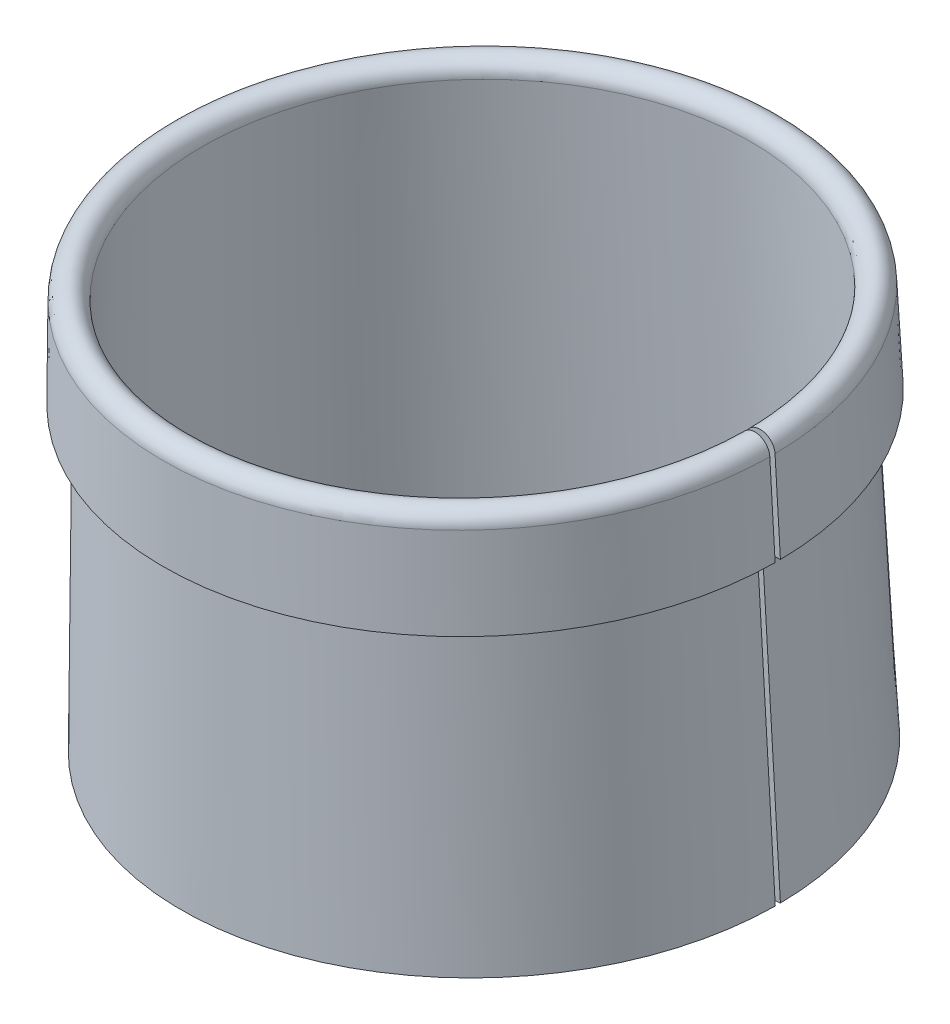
ISO-10303-21;
HEADER;
FILE_DESCRIPTION(('STEP AP214'),'2;1');
FILE_NAME('part.step','',(''),(''),'','','');
FILE_SCHEMA(('AUTOMOTIVE_DESIGN { 1 0 10303 214 1 1 1 1 }'));
ENDSEC;
DATA;
#1=APPLICATION_CONTEXT('core data for automotive mechanical design processes');
#2=APPLICATION_PROTOCOL_DEFINITION('international standard','automotive_design',2000,#1);
#3=PRODUCT_CONTEXT('',#1,'mechanical');
#4=PRODUCT('Part','Part','',(#3));
#5=PRODUCT_RELATED_PRODUCT_CATEGORY('part','',(#4));
#6=PRODUCT_DEFINITION_FORMATION('','',#4);
#7=PRODUCT_DEFINITION_CONTEXT('part definition',#1,'design');
#8=PRODUCT_DEFINITION('design','',#6,#7);
#9=PRODUCT_DEFINITION_SHAPE('','',#8);
#10=(LENGTH_UNIT() NAMED_UNIT(*) SI_UNIT(.MILLI.,.METRE.));
#11=(NAMED_UNIT(*) PLANE_ANGLE_UNIT() SI_UNIT($,.RADIAN.));
#12=(NAMED_UNIT(*) SI_UNIT($,.STERADIAN.) SOLID_ANGLE_UNIT());
#13=UNCERTAINTY_MEASURE_WITH_UNIT(LENGTH_MEASURE(1.E-05),#10,'distance_accuracy_value','');
#14=(GEOMETRIC_REPRESENTATION_CONTEXT(3) GLOBAL_UNCERTAINTY_ASSIGNED_CONTEXT((#13)) GLOBAL_UNIT_ASSIGNED_CONTEXT((#10,
#11,#12)) REPRESENTATION_CONTEXT('',''));
#15=CARTESIAN_POINT('',(0.,0.,0.));
#16=DIRECTION('',(0.,0.,1.));
#17=DIRECTION('',(1.,0.,0.));
#18=AXIS2_PLACEMENT_3D('',#15,#16,#17);
#19=CARTESIAN_POINT('',(21.0923203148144,68.0425691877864,150.691431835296));
#20=DIRECTION('',(0.00872258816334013,0.000262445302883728,-0.999961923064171));
#21=DIRECTION('',(-0.998153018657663,-0.0601204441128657,-0.00872258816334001));
#22=AXIS2_PLACEMENT_3D('',#19,#20,#21);
#23=PLANE('',#22);
#24=CARTESIAN_POINT('',(18.0679166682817,67.8604042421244,150.665002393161));
#25=CARTESIAN_POINT('',(18.0674246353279,67.8685706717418,150.665000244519));
#26=CARTESIAN_POINT('',(18.067133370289,67.8767491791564,150.66499985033));
#27=CARTESIAN_POINT('',(18.0669523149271,67.8931106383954,150.66500256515));
#28=CARTESIAN_POINT('',(18.0670625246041,67.9012935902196,150.665005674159));
#29=CARTESIAN_POINT('',(18.0676843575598,67.9176442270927,150.66501538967));
#30=CARTESIAN_POINT('',(18.0681959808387,67.9258119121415,150.665021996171));
#31=CARTESIAN_POINT('',(18.0696193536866,67.9421123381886,150.665038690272));
#32=CARTESIAN_POINT('',(18.0705311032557,67.950245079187,150.665048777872));
#33=CARTESIAN_POINT('',(18.0727525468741,67.9664560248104,150.665072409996));
#34=CARTESIAN_POINT('',(18.0740622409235,67.9745342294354,150.665085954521));
#35=CARTESIAN_POINT('',(18.0770764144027,67.990616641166,150.66511646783));
#36=CARTESIAN_POINT('',(18.0787808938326,67.9986208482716,150.665133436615));
#37=CARTESIAN_POINT('',(18.0825805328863,68.014535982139,150.665170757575));
#38=CARTESIAN_POINT('',(18.0846756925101,68.0224469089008,150.66519110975));
#39=CARTESIAN_POINT('',(18.0892516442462,68.0381564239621,150.665235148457));
#40=CARTESIAN_POINT('',(18.0917324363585,68.0459550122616,150.66525883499));
#41=CARTESIAN_POINT('',(18.0970736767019,68.0614210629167,150.665309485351));
#42=CARTESIAN_POINT('',(18.0999341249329,68.0690885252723,150.665336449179));
#43=CARTESIAN_POINT('',(18.106027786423,68.0842738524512,150.665393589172));
#44=CARTESIAN_POINT('',(18.1092609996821,68.0917917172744,150.665423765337));
#45=CARTESIAN_POINT('',(18.1160924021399,68.1066597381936,150.665487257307));
#46=CARTESIAN_POINT('',(18.1196905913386,68.1140098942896,150.665520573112));
#47=CARTESIAN_POINT('',(18.1272432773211,68.1285247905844,150.665590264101));
#48=CARTESIAN_POINT('',(18.131197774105,68.1356895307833,150.665626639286));
#49=CARTESIAN_POINT('',(18.1394535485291,68.1498163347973,150.665702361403));
#50=CARTESIAN_POINT('',(18.1437548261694,68.1567783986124,150.665741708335));
#51=CARTESIAN_POINT('',(18.1526938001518,68.1704830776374,150.665823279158));
#52=CARTESIAN_POINT('',(18.1573314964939,68.1772256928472,150.665865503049));
#53=CARTESIAN_POINT('',(18.1669321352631,68.1904752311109,150.665952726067));
#54=CARTESIAN_POINT('',(18.1718950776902,68.1969821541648,150.665997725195));
#55=CARTESIAN_POINT('',(18.1821342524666,68.209744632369,150.666090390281));
#56=CARTESIAN_POINT('',(18.1874104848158,68.2160001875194,150.666138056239));
#57=CARTESIAN_POINT('',(18.1982635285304,68.2282448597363,150.666235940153));
#58=CARTESIAN_POINT('',(18.2038403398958,68.2342339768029,150.66628615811));
#59=CARTESIAN_POINT('',(18.2152811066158,68.2459313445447,150.666389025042));
#60=CARTESIAN_POINT('',(18.2211450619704,68.2516395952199,150.666441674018));
#61=CARTESIAN_POINT('',(18.2331459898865,68.262761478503,150.666549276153));
#62=CARTESIAN_POINT('',(18.2392829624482,68.268175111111,150.666604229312));
#63=CARTESIAN_POINT('',(18.2518151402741,68.2786947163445,150.666716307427));
#64=CARTESIAN_POINT('',(18.2582103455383,68.28380068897,150.666773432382));
#65=CARTESIAN_POINT('',(18.2712435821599,68.2936926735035,150.66688971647));
#66=CARTESIAN_POINT('',(18.2778816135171,68.2984786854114,150.666948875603));
#67=CARTESIAN_POINT('',(18.2913845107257,68.3077192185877,150.667069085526));
#68=CARTESIAN_POINT('',(18.298249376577,68.3121737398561,150.667130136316));
#69=CARTESIAN_POINT('',(18.3121894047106,68.3207405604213,150.667253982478));
#70=CARTESIAN_POINT('',(18.3192645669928,68.3248528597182,150.66731677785));
#71=CARTESIAN_POINT('',(18.3336081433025,68.3327253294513,150.667443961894));
#72=CARTESIAN_POINT('',(18.34087655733,68.3364854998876,150.667508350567));
#73=CARTESIAN_POINT('',(18.3555891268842,68.3436446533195,150.667638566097));
#74=CARTESIAN_POINT('',(18.3630332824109,68.3470436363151,150.667704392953));
#75=CARTESIAN_POINT('',(18.3780794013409,68.3534722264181,150.667837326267));
#76=CARTESIAN_POINT('',(18.3856813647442,68.3565018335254,150.667904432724));
#77=CARTESIAN_POINT('',(18.4010247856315,68.3621843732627,150.668039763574));
#78=CARTESIAN_POINT('',(18.4087662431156,68.3648373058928,150.668107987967));
#79=CARTESIAN_POINT('',(18.4243700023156,68.3697601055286,150.66824539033));
#80=CARTESIAN_POINT('',(18.4322323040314,68.3720299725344,150.6683145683));
#81=CARTESIAN_POINT('',(18.4480588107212,68.3761811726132,150.668453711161));
#82=CARTESIAN_POINT('',(18.4560230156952,68.3780625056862,150.668523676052));
#83=CARTESIAN_POINT('',(18.4720341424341,68.3814321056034,150.668664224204));
#84=CARTESIAN_POINT('',(18.4800810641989,68.3829203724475,150.668734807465));
#85=CARTESIAN_POINT('',(18.4962382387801,68.3855002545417,150.668876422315));
#86=CARTESIAN_POINT('',(18.5043484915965,68.3865918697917,150.668947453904));
#87=CARTESIAN_POINT('',(18.5206127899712,68.388375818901,150.669089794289));
#88=CARTESIAN_POINT('',(18.5287668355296,68.3890681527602,150.669161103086));
#89=CARTESIAN_POINT('',(18.5450990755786,68.3900518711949,150.669303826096));
#90=CARTESIAN_POINT('',(18.5532772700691,68.3903432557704,150.66937524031));
#91=CARTESIAN_POINT('',(18.5696381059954,68.3905243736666,150.669518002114));
#92=CARTESIAN_POINT('',(18.5778207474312,68.3904141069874,150.669589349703));
#93=CARTESIAN_POINT('',(18.5941707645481,68.3897921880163,150.669731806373));
#94=CARTESIAN_POINT('',(18.6023381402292,68.3892805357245,150.669802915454));
#95=CARTESIAN_POINT('',(18.6186379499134,68.3878570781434,150.669944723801));
#96=CARTESIAN_POINT('',(18.6267703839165,68.3869452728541,150.670015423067));
#97=CARTESIAN_POINT('',(18.6429807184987,68.3847237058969,150.670156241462));
#98=CARTESIAN_POINT('',(18.6510586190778,68.383413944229,150.670226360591));
#99=CARTESIAN_POINT('',(18.6671404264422,68.3803996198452,150.670365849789));
#100=CARTESIAN_POINT('',(18.6751443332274,68.3786950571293,150.670435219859));
#101=CARTESIAN_POINT('',(18.6910588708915,68.3748952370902,150.67057304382));
#102=CARTESIAN_POINT('',(18.6989695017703,68.3727999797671,150.670641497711));
#103=CARTESIAN_POINT('',(18.7146784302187,68.3682238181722,150.670777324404));
#104=CARTESIAN_POINT('',(18.7224767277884,68.3657429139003,150.670844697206));
#105=CARTESIAN_POINT('',(18.7379422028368,68.3604014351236,150.670978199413));
#106=CARTESIAN_POINT('',(18.7456093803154,68.3575408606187,150.671044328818));
#107=CARTESIAN_POINT('',(18.7607941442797,68.3514469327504,150.67117518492));
#108=CARTESIAN_POINT('',(18.7683117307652,68.348213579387,150.671239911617));
#109=CARTESIAN_POINT('',(18.7831792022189,68.3413818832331,150.671367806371));
#110=CARTESIAN_POINT('',(18.790529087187,68.3377835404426,150.671430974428));
#111=CARTESIAN_POINT('',(18.8050434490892,68.3302305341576,150.671555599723));
#112=CARTESIAN_POINT('',(18.8122079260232,68.3262758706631,150.671617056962));
#113=CARTESIAN_POINT('',(18.8263342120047,68.3180197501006,150.671738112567));
#114=CARTESIAN_POINT('',(18.8332960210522,68.3137182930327,150.671797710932));
#115=CARTESIAN_POINT('',(18.8470001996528,68.3047789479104,150.671914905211));
#116=CARTESIAN_POINT('',(18.853742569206,68.3001410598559,150.671972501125));
#117=CARTESIAN_POINT('',(18.8669916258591,68.2905400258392,150.672085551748));
#118=CARTESIAN_POINT('',(18.8734983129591,68.2855768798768,150.672141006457));
#119=CARTESIAN_POINT('',(18.8862603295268,68.2753372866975,150.672249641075));
#120=CARTESIAN_POINT('',(18.8925156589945,68.2700608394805,150.672302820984));
#121=CARTESIAN_POINT('',(18.904759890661,68.2592073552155,150.672406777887));
#122=CARTESIAN_POINT('',(18.9107487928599,68.2536303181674,150.672457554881));
#123=CARTESIAN_POINT('',(18.9224457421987,68.2421890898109,150.672556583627));
#124=CARTESIAN_POINT('',(18.9281537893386,68.2363248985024,150.672604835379));
#125=CARTESIAN_POINT('',(18.9392752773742,68.2243234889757,150.672698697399));
#126=CARTESIAN_POINT('',(18.9446887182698,68.2181862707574,150.672744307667));
#127=CARTESIAN_POINT('',(18.9552079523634,68.2056535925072,150.67283277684));
#128=CARTESIAN_POINT('',(18.9603137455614,68.1992581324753,150.672875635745));
#129=CARTESIAN_POINT('',(18.9702053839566,68.1862243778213,150.67295849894));
#130=CARTESIAN_POINT('',(18.9749912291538,68.1795860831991,150.672998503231));
#131=CARTESIAN_POINT('',(18.9842314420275,68.1660826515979,150.673075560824));
#132=CARTESIAN_POINT('',(18.9886858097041,68.1592175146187,150.673112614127));
#133=CARTESIAN_POINT('',(18.9972523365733,68.1452769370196,150.67318368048));
#134=CARTESIAN_POINT('',(19.0013644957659,68.1382014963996,150.67321769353));
#135=CARTESIAN_POINT('',(19.0092366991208,68.1238573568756,150.673282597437));
#136=CARTESIAN_POINT('',(19.0129967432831,68.1165886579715,150.673313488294));
#137=CARTESIAN_POINT('',(19.0201556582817,68.1018755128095,150.673372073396));
#138=CARTESIAN_POINT('',(19.0235545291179,68.0944310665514,150.673399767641));
#139=CARTESIAN_POINT('',(19.0299829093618,68.0793843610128,150.673451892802));
#140=CARTESIAN_POINT('',(19.0330124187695,68.0717821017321,150.673476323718));
#141=CARTESIAN_POINT('',(19.0386947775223,68.0564380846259,150.673521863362));
#142=CARTESIAN_POINT('',(19.0413476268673,68.0486963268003,150.67354297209));
#143=CARTESIAN_POINT('',(19.0462702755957,68.0330919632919,150.673581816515));
#144=CARTESIAN_POINT('',(19.0485400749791,68.025229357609,150.673599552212));
#145=CARTESIAN_POINT('',(19.0526911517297,68.0094022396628,150.673631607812));
#146=CARTESIAN_POINT('',(19.054572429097,68.0014377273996,150.673645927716));
#147=CARTESIAN_POINT('',(19.0579419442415,67.9854259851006,150.673671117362));
#148=CARTESIAN_POINT('',(19.0594301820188,67.9773787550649,150.673681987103));
#149=CARTESIAN_POINT('',(19.0620099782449,67.9612209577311,150.673700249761));
#150=CARTESIAN_POINT('',(19.0631015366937,67.9531103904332,150.673707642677));
#151=CARTESIAN_POINT('',(19.0648855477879,67.9368454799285,150.673718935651));
#152=CARTESIAN_POINT('',(19.0655780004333,67.9286911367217,150.67372283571));
#153=CARTESIAN_POINT('',(19.0660696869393,67.9205246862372,150.673724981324));
#154=B_SPLINE_CURVE_WITH_KNOTS('',3,(#24,#25,#26,#27,#28,#29,#30,#31,#32,#33,#34,#35,#36,#37,
#38,#39,#40,#41,#42,#43,#44,#45,#46,#47,#48,#49,#50,#51,#52,#53,#54,#55,#56,#57,#58,#59,#60,#61,
#62,#63,#64,#65,#66,#67,#68,#69,#70,#71,#72,#73,#74,#75,#76,#77,#78,#79,#80,#81,#82,#83,#84,#85,
#86,#87,#88,#89,#90,#91,#92,#93,#94,#95,#96,#97,#98,#99,#100,#101,#102,#103,#104,#105,#106,#107,
#108,#109,#110,#111,#112,#113,#114,#115,#116,#117,#118,#119,#120,#121,#122,#123,#124,#125,#126,
#127,#128,#129,#130,#131,#132,#133,#134,#135,#136,#137,#138,#139,#140,#141,#142,#143,#144,#145,
#146,#147,#148,#149,#150,#151,#152,#153),.UNSPECIFIED.,.F.,.F.,(4,2,2,2,2,2,2,2,2,2,2,2,2,2,2,2,
2,2,2,2,2,2,2,2,2,2,2,2,2,2,2,2,2,2,2,2,2,2,2,2,2,2,2,2,2,2,2,2,2,2,2,2,2,2,2,2,2,2,2,2,2,2,2,2,
4),(0.,0.0245412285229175,0.049082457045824,0.073623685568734,0.0981649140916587,
0.122706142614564,0.147247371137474,0.171788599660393,0.196329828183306,0.220871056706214,
0.245412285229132,0.269953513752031,0.294494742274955,0.319035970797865,0.34357719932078,
0.368118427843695,0.392659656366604,0.417200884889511,0.441742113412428,0.466283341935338,
0.49082457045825,0.51536579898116,0.539907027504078,0.564448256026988,0.588989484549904,
0.613530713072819,0.638071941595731,0.662613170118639,0.687154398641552,0.711695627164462,
0.736236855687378,0.760778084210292,0.785319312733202,0.809860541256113,0.834401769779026,
0.858942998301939,0.883484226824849,0.908025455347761,0.932566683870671,0.957107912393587,
0.981649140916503,1.00619036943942,1.03073159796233,1.05527282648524,1.07981405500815,
1.10435528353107,1.12889651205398,1.15343774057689,1.1779789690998,1.20252019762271,
1.22706142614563,1.25160265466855,1.27614388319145,1.30068511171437,1.32522634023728,
1.34976756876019,1.3743087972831,1.39885002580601,1.42339125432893,1.44793248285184,
1.47247371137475,1.49701493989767,1.52155616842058,1.54609739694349,1.57063862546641),.UNSPECIFIED.);
#155=CARTESIAN_POINT('',(18.0679166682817,67.8604042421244,150.665002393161));
#156=VERTEX_POINT('',#155);
#157=CARTESIAN_POINT('',(19.0660696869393,67.9205246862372,150.673724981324));
#158=VERTEX_POINT('',#157);
#159=EDGE_CURVE('E568',#156,#158,#154,.T.);
#160=ORIENTED_EDGE('',*,*,#159,.F.);
#161=DIRECTION('',(-0.0601204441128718,0.998191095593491,-0.000262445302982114));
#162=VECTOR('',#161,1.);
#163=CARTESIAN_POINT('',(20.0218311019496,35.4191936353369,150.673531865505));
#164=LINE('',#163,#162);
#165=CARTESIAN_POINT('',(21.975745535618,2.97798302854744,150.682061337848));
#166=VERTEX_POINT('',#165);
#167=EDGE_CURVE('E565',#166,#156,#164,.T.);
#168=ORIENTED_EDGE('',*,*,#167,.F.);
#169=DIRECTION('',(0.998153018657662,0.0601204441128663,0.00872258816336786));
#170=VECTOR('',#169,1.);
#171=CARTESIAN_POINT('',(20.9775925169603,2.91786258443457,150.673338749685));
#172=LINE('',#171,#170);
#173=CARTESIAN_POINT('',(19.9794394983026,2.8577421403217,150.664616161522));
#174=VERTEX_POINT('',#173);
#175=EDGE_CURVE('E548',#174,#166,#172,.T.);
#176=ORIENTED_EDGE('',*,*,#175,.F.);
#177=DIRECTION('',(-0.0601204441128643,0.998191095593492,-0.000262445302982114));
#178=VECTOR('',#177,1.);
#179=CARTESIAN_POINT('',(18.0255250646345,35.2989527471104,150.656086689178));
#180=LINE('',#179,#178);
#181=CARTESIAN_POINT('',(16.0716106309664,67.7401633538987,150.647557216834));
#182=VERTEX_POINT('',#181);
#183=EDGE_CURVE('E274',#174,#182,#180,.T.);
#184=ORIENTED_EDGE('',*,*,#183,.T.);
#185=CARTESIAN_POINT('',(16.0716106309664,67.7401633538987,150.647557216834));
#186=CARTESIAN_POINT('',(16.0316890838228,68.2276212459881,150.647336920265));
#187=CARTESIAN_POINT('',(16.2017766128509,68.707828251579,150.648946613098));
#188=CARTESIAN_POINT('',(16.3664258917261,69.1726814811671,150.650504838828));
#189=CARTESIAN_POINT('',(16.6979150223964,69.5477861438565,150.653494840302));
#190=CARTESIAN_POINT('',(17.0292718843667,69.9227411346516,150.656483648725));
#191=CARTESIAN_POINT('',(17.4728655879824,70.138302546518,150.660409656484));
#192=CARTESIAN_POINT('',(17.9207232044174,70.3559359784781,150.664373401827));
#193=CARTESIAN_POINT('',(18.4166920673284,70.3859422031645,150.668707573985));
#194=CARTESIAN_POINT('',(18.9113327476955,70.4158680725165,150.673030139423));
#195=CARTESIAN_POINT('',(19.3834179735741,70.2533783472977,150.677105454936));
#196=CARTESIAN_POINT('',(19.8485438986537,70.0932839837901,150.681120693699));
#197=CARTESIAN_POINT('',(20.2236420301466,69.7601466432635,150.684305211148));
#198=CARTESIAN_POINT('',(20.5969311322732,69.4286159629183,150.687474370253));
#199=CARTESIAN_POINT('',(20.817008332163,68.985811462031,150.689277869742));
#200=CARTESIAN_POINT('',(21.0434770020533,68.5301470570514,150.691133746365));
#201=CARTESIAN_POINT('',(21.0623757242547,68.040765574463,150.691170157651));
#202=B_SPLINE_CURVE_WITH_KNOTS('',2,(#185,#186,#187,#188,#189,#190,#191,#192,#193,#194,#195,
#196,#197,#198,#199,#200,#201),.UNSPECIFIED.,.F.,.F.,(3,2,2,2,2,2,2,2,3),(0.,0.125,0.25,0.375,
0.5,0.625,0.75,0.875,1.),.UNSPECIFIED.);
#203=CARTESIAN_POINT('',(21.0623757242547,68.040765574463,150.691170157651));
#204=VERTEX_POINT('',#203);
#205=EDGE_CURVE('E13',#182,#204,#202,.T.);
#206=ORIENTED_EDGE('',*,*,#205,.T.);
#207=DIRECTION('',(0.0601204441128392,-0.998191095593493,0.000262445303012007));
#208=VECTOR('',#207,1.);
#209=CARTESIAN_POINT('',(21.5132790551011,60.5543323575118,150.693138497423));
#210=LINE('',#209,#208);
#211=CARTESIAN_POINT('',(21.9641823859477,53.0678991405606,150.695106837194));
#212=VERTEX_POINT('',#211);
#213=EDGE_CURVE('E419',#204,#212,#210,.T.);
#214=ORIENTED_EDGE('',*,*,#213,.T.);
#215=DIRECTION('',(0.998153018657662,0.0601204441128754,0.00872258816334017));
#216=VECTOR('',#215,1.);
#217=CARTESIAN_POINT('',(20.96602936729,53.0077786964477,150.686384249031));
#218=LINE('',#217,#216);
#219=CARTESIAN_POINT('',(19.9678763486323,52.9476582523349,150.677661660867));
#220=VERTEX_POINT('',#219);
#221=EDGE_CURVE('E339',#220,#212,#218,.T.);
#222=ORIENTED_EDGE('',*,*,#221,.F.);
#223=DIRECTION('',(0.0601204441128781,-0.998191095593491,0.000262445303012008));
#224=VECTOR('',#223,1.);
#225=CARTESIAN_POINT('',(19.5169730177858,60.4340914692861,150.675693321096));
#226=LINE('',#225,#224);
#227=EDGE_CURVE('E345',#158,#220,#226,.T.);
#228=ORIENTED_EDGE('',*,*,#227,.F.);
#229=EDGE_LOOP('',(#160,#168,#176,#184,#206,#214,#222,#228));
#230=FACE_BOUND('',#229,.T.);
#231=ADVANCED_FACE('F261',(#230),#23,.T.);
#232=CARTESIAN_POINT('',(16.0416660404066,67.7383597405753,149.852704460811));
#233=DIRECTION('',(0.00872258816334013,0.000262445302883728,0.999961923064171));
#234=DIRECTION('',(0.998153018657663,0.0601204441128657,-0.00872258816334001));
#235=AXIS2_PLACEMENT_3D('',#232,#233,#234);
#236=PLANE('',#235);
#237=CARTESIAN_POINT('',(18.0679166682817,67.8604042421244,149.834997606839));
#238=CARTESIAN_POINT('',(18.5069328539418,68.8876573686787,149.830898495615));
#239=CARTESIAN_POINT('',(19.0660696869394,67.9205246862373,149.826275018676));
#240=B_SPLINE_CURVE_WITH_KNOTS('',2,(#237,#238,#239),.UNSPECIFIED.,.F.,.F.,(3,3),(0.,1.),.UNSPECIFIED.);
#241=CARTESIAN_POINT('',(18.0679166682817,67.8604042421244,149.834997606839));
#242=VERTEX_POINT('',#241);
#243=CARTESIAN_POINT('',(19.0660696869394,67.9205246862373,149.826275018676));
#244=VERTEX_POINT('',#243);
#245=EDGE_CURVE('E433',#242,#244,#240,.T.);
#246=ORIENTED_EDGE('',*,*,#245,.T.);
#247=DIRECTION('',(0.0601204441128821,-0.998191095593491,-0.000262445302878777));
#248=VECTOR('',#247,1.);
#249=CARTESIAN_POINT('',(19.5169730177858,60.4340914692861,149.824306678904));
#250=LINE('',#249,#248);
#251=CARTESIAN_POINT('',(19.9678763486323,52.9476582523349,149.822338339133));
#252=VERTEX_POINT('',#251);
#253=EDGE_CURVE('E353',#244,#252,#250,.T.);
#254=ORIENTED_EDGE('',*,*,#253,.T.);
#255=DIRECTION('',(0.998153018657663,0.0601204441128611,-0.00872258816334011));
#256=VECTOR('',#255,1.);
#257=CARTESIAN_POINT('',(20.96602936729,53.0077786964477,149.813615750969));
#258=LINE('',#257,#256);
#259=CARTESIAN_POINT('',(21.9641823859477,53.0678991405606,149.804893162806));
#260=VERTEX_POINT('',#259);
#261=EDGE_CURVE('E337',#252,#260,#258,.T.);
#262=ORIENTED_EDGE('',*,*,#261,.T.);
#263=DIRECTION('',(0.0601204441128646,-0.998191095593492,-0.000262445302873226));
#264=VECTOR('',#263,1.);
#265=CARTESIAN_POINT('',(21.5132790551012,60.5543323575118,149.806861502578));
#266=LINE('',#265,#264);
#267=CARTESIAN_POINT('',(21.0623757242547,68.040765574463,149.808829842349));
#268=VERTEX_POINT('',#267);
#269=EDGE_CURVE('E352',#268,#260,#266,.T.);
#270=ORIENTED_EDGE('',*,*,#269,.F.);
#271=CARTESIAN_POINT('',(16.0716106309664,67.7401633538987,149.852442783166));
#272=CARTESIAN_POINT('',(16.0691504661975,67.7809955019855,149.852453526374));
#273=CARTESIAN_POINT('',(16.0676941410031,67.8218880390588,149.852455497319));
#274=CARTESIAN_POINT('',(16.0667888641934,67.9036953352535,149.852441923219));
#275=CARTESIAN_POINT('',(16.0673399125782,67.9446100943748,149.852426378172));
#276=CARTESIAN_POINT('',(16.0704490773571,68.02636327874,149.852377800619));
#277=CARTESIAN_POINT('',(16.0730071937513,68.067201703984,149.852344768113));
#278=CARTESIAN_POINT('',(16.080124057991,68.1487038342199,149.852261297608));
#279=CARTESIAN_POINT('',(16.0846828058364,68.1893675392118,149.852210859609));
#280=CARTESIAN_POINT('',(16.0957900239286,68.2704222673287,149.852092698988));
#281=CARTESIAN_POINT('',(16.1023384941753,68.3108132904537,149.852024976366));
#282=CARTESIAN_POINT('',(16.1174093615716,68.3912253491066,149.85187240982));
#283=CARTESIAN_POINT('',(16.1259317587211,68.4312463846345,149.851787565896));
#284=CARTESIAN_POINT('',(16.1449299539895,68.5108220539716,149.851600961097));
#285=CARTESIAN_POINT('',(16.1554057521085,68.5503766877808,149.851499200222));
#286=CARTESIAN_POINT('',(16.1782855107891,68.6289242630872,149.851279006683));
#287=CARTESIAN_POINT('',(16.1906894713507,68.6679172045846,149.851160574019));
#288=CARTESIAN_POINT('',(16.2173956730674,68.7452474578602,149.850907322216));
#289=CARTESIAN_POINT('',(16.2316979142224,68.7835847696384,149.850772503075));
#290=CARTESIAN_POINT('',(16.262166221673,68.8595114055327,149.85048680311));
#291=CARTESIAN_POINT('',(16.2783322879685,68.8971007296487,149.850335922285));
#292=CARTESIAN_POINT('',(16.3124893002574,68.9714408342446,149.850018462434));
#293=CARTESIAN_POINT('',(16.3304802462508,69.0081916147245,149.849851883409));
#294=CARTESIAN_POINT('',(16.3682436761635,69.0807660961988,149.849503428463));
#295=CARTESIAN_POINT('',(16.3880161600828,69.1165897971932,149.849321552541));
#296=CARTESIAN_POINT('',(16.4292950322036,69.1872238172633,149.848942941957));
#297=CARTESIAN_POINT('',(16.4508014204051,69.2220341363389,149.848746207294));
#298=CARTESIAN_POINT('',(16.495496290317,69.2905575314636,149.848338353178));
#299=CARTESIAN_POINT('',(16.5186847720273,69.3242706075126,149.848127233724));
#300=CARTESIAN_POINT('',(16.5666879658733,69.3905182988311,149.847691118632));
#301=CARTESIAN_POINT('',(16.5915026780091,69.4230529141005,149.847466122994));
#302=CARTESIAN_POINT('',(16.6426985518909,69.4868653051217,149.847002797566));
#303=CARTESIAN_POINT('',(16.6690797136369,69.5181430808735,149.846764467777));
#304=CARTESIAN_POINT('',(16.7233449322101,69.5793664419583,149.846275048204));
#305=CARTESIAN_POINT('',(16.7512289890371,69.6093120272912,149.846023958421));
#306=CARTESIAN_POINT('',(16.8084328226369,69.6677988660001,149.845509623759));
#307=CARTESIAN_POINT('',(16.8377525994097,69.696340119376,149.84524637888));
#308=CARTESIAN_POINT('',(16.8977572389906,69.7519495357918,149.844708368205));
#309=CARTESIAN_POINT('',(16.9284421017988,69.7790176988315,149.844433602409));
#310=CARTESIAN_POINT('',(16.9911029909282,69.8316157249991,149.843873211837));
#311=CARTESIAN_POINT('',(17.0230790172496,69.857145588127,149.84358758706));
#312=CARTESIAN_POINT('',(17.0882452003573,69.9066055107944,149.843006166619));
#313=CARTESIAN_POINT('',(17.1214353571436,69.9305355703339,149.842710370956));
#314=CARTESIAN_POINT('',(17.1889498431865,69.9767382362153,149.84210932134));
#315=CARTESIAN_POINT('',(17.2232741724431,69.9990108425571,149.841804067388));
#316=CARTESIAN_POINT('',(17.2929743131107,70.0418449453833,149.841184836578));
#317=CARTESIAN_POINT('',(17.3283501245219,70.0624064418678,149.840870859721));
#318=CARTESIAN_POINT('',(17.4000680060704,70.1017687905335,149.840234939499));
#319=CARTESIAN_POINT('',(17.4364100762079,70.1205696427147,149.839912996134));
#320=CARTESIAN_POINT('',(17.5099729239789,70.1563654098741,149.839261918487));
#321=CARTESIAN_POINT('',(17.5471937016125,70.1733603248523,149.838932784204));
#322=CARTESIAN_POINT('',(17.6224242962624,70.205503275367,149.838268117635));
#323=CARTESIAN_POINT('',(17.6604341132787,70.2206513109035,149.837932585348));
#324=CARTESIAN_POINT('',(17.7371512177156,70.2490640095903,149.837255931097));
#325=CARTESIAN_POINT('',(17.7758585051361,70.2623286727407,149.836914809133));
#326=CARTESIAN_POINT('',(17.8538773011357,70.2869426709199,149.836227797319));
#327=CARTESIAN_POINT('',(17.8931888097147,70.2982920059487,149.835881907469));
#328=CARTESIAN_POINT('',(17.9723213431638,70.3190480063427,149.835186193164));
#329=CARTESIAN_POINT('',(18.0121423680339,70.3284546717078,149.834836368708));
#330=CARTESIAN_POINT('',(18.0921980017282,70.3453026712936,149.834133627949));
#331=CARTESIAN_POINT('',(18.1324326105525,70.3527440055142,149.833780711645));
#332=CARTESIAN_POINT('',(18.2132184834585,70.3656434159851,149.833072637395));
#333=CARTESIAN_POINT('',(18.2537697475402,70.3711014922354,149.83271747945));
#334=CARTESIAN_POINT('',(18.3350912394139,70.3800212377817,149.832005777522));
#335=CARTESIAN_POINT('',(18.375861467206,70.3834829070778,149.831649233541));
#336=CARTESIAN_POINT('',(18.4575226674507,70.3884014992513,149.830935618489));
#337=CARTESIAN_POINT('',(18.4984136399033,70.3898584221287,149.830578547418));
#338=CARTESIAN_POINT('',(18.580217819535,70.3907640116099,149.829864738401));
#339=CARTESIAN_POINT('',(18.6211310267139,70.3902126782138,149.829508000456));
#340=CARTESIAN_POINT('',(18.7028811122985,70.3871030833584,149.828795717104));
#341=CARTESIAN_POINT('',(18.7437179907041,70.3845448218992,149.828440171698));
#342=CARTESIAN_POINT('',(18.8252170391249,70.3774275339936,149.827731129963));
#343=CARTESIAN_POINT('',(18.8658792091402,70.3728685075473,149.827377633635));
#344=CARTESIAN_POINT('',(18.9469308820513,70.3617606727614,149.826673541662));
#345=CARTESIAN_POINT('',(18.9873203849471,70.3552118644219,149.826322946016));
#346=CARTESIAN_POINT('',(19.067729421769,70.3401402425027,149.825625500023));
#347=CARTESIAN_POINT('',(19.1077489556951,70.331617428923,149.825278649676));
#348=CARTESIAN_POINT('',(19.1873216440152,70.3126183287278,149.824589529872));
#349=CARTESIAN_POINT('',(19.2268747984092,70.3021420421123,149.824247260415));
#350=CARTESIAN_POINT('',(19.3054194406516,70.2792612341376,149.823568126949));
#351=CARTESIAN_POINT('',(19.3444109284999,70.2668567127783,149.823231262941));
#352=CARTESIAN_POINT('',(19.4217383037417,70.2401493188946,149.822563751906));
#353=CARTESIAN_POINT('',(19.460074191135,70.2258464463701,149.82223310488));
#354=CARTESIAN_POINT('',(19.5359980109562,70.1953768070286,149.821578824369));
#355=CARTESIAN_POINT('',(19.5735859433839,70.1792100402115,149.821255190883));
#356=CARTESIAN_POINT('',(19.6479233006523,70.1450515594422,149.820615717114));
#357=CARTESIAN_POINT('',(19.6846727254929,70.1270598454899,149.820299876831));
#358=CARTESIAN_POINT('',(19.7572445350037,70.0892948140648,149.819676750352));
#359=CARTESIAN_POINT('',(19.7930669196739,70.069521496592,149.819369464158));
#360=CARTESIAN_POINT('',(19.8636983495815,70.0282408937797,149.818764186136));
#361=CARTESIAN_POINT('',(19.8985073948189,70.0067336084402,149.81846619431));
#362=CARTESIAN_POINT('',(19.967028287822,69.9620368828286,149.817880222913));
#363=CARTESIAN_POINT('',(20.0007401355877,69.9388474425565,149.817592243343));
#364=CARTESIAN_POINT('',(20.0669854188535,69.8908422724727,149.817026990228));
#365=CARTESIAN_POINT('',(20.0995188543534,69.8660265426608,149.816749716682));
#366=CARTESIAN_POINT('',(20.1633289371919,69.8148285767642,149.816206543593));
#367=CARTESIAN_POINT('',(20.1946055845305,69.7884463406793,149.815940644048));
#368=CARTESIAN_POINT('',(20.2558267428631,69.7341789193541,149.815420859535));
#369=CARTESIAN_POINT('',(20.2857712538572,69.7062937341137,149.815166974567));
#370=CARTESIAN_POINT('',(20.3442560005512,69.6490875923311,149.814671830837));
#371=CARTESIAN_POINT('',(20.3727962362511,69.6197666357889,149.814430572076));
#372=CARTESIAN_POINT('',(20.428403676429,69.5597595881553,149.813961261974));
#373=CARTESIAN_POINT('',(20.455470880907,69.5290734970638,149.813733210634));
#374=CARTESIAN_POINT('',(20.5080670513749,69.4664101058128,149.813290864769));
#375=CARTESIAN_POINT('',(20.5335960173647,69.4344328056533,149.813076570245));
#376=CARTESIAN_POINT('',(20.5830542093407,69.3692640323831,149.812662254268));
#377=CARTESIAN_POINT('',(20.6069834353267,69.3360725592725,149.812462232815));
#378=CARTESIAN_POINT('',(20.6531844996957,69.2685554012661,149.812076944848));
#379=CARTESIAN_POINT('',(20.6754563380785,69.2342297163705,149.811891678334));
#380=CARTESIAN_POINT('',(20.7182889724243,69.1645268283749,149.811536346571));
#381=CARTESIAN_POINT('',(20.7388497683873,69.129149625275,149.81136628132));
#382=CARTESIAN_POINT('',(20.7782107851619,69.0574289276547,149.811041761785));
#383=CARTESIAN_POINT('',(20.7970110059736,69.0210854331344,149.8108873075));
#384=CARTESIAN_POINT('',(20.8328055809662,68.947519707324,149.810594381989));
#385=CARTESIAN_POINT('',(20.8497999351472,68.9102974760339,149.810455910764));
#386=CARTESIAN_POINT('',(20.8819418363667,68.8350639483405,149.810195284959));
#387=CARTESIAN_POINT('',(20.8970893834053,68.7970526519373,149.810073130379));
#388=CARTESIAN_POINT('',(20.9255011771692,68.7203325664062,149.809845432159));
#389=CARTESIAN_POINT('',(20.9387654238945,68.6816237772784,149.809739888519));
#390=CARTESIAN_POINT('',(20.9633786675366,68.6036019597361,149.809545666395));
#391=CARTESIAN_POINT('',(20.9747276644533,68.5642889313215,149.809456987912));
#392=CARTESIAN_POINT('',(20.9954830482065,68.485153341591,149.809296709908));
#393=CARTESIAN_POINT('',(21.0048894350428,68.4453307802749,149.809225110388));
#394=CARTESIAN_POINT('',(21.0217370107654,68.36527206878,149.80909916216));
#395=CARTESIAN_POINT('',(21.0291781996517,68.3250359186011,149.809044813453));
#396=CARTESIAN_POINT('',(21.0420771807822,68.2442469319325,149.808953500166));
#397=CARTESIAN_POINT('',(21.0475349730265,68.2036940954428,149.808916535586));
#398=CARTESIAN_POINT('',(21.0564550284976,68.1223695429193,149.808860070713));
#399=CARTESIAN_POINT('',(21.0599172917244,68.0815978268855,149.808840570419));
#400=CARTESIAN_POINT('',(21.0623757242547,68.040765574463,149.808829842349));
#401=B_SPLINE_CURVE_WITH_KNOTS('',3,(#271,#272,#273,#274,#275,#276,#277,#278,#279,#280,#281,
#282,#283,#284,#285,#286,#287,#288,#289,#290,#291,#292,#293,#294,#295,#296,#297,#298,#299,#300,
#301,#302,#303,#304,#305,#306,#307,#308,#309,#310,#311,#312,#313,#314,#315,#316,#317,#318,#319,
#320,#321,#322,#323,#324,#325,#326,#327,#328,#329,#330,#331,#332,#333,#334,#335,#336,#337,#338,
#339,#340,#341,#342,#343,#344,#345,#346,#347,#348,#349,#350,#351,#352,#353,#354,#355,#356,#357,
#358,#359,#360,#361,#362,#363,#364,#365,#366,#367,#368,#369,#370,#371,#372,#373,#374,#375,#376,
#377,#378,#379,#380,#381,#382,#383,#384,#385,#386,#387,#388,#389,#390,#391,#392,#393,#394,#395,
#396,#397,#398,#399,#400),.UNSPECIFIED.,.F.,.F.,(4,2,2,2,2,2,2,2,2,2,2,2,2,2,2,2,2,2,2,2,2,2,2,
2,2,2,2,2,2,2,2,2,2,2,2,2,2,2,2,2,2,2,2,2,2,2,2,2,2,2,2,2,2,2,2,2,2,2,2,2,2,2,2,2,4),(0.,
0.122706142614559,0.245412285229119,0.368118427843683,0.490824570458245,0.613530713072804,
0.736236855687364,0.858942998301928,0.98164914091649,1.10435528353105,1.22706142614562,
1.34976756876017,1.47247371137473,1.5951798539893,1.71788599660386,1.84059213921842,
1.96329828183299,2.08600442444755,2.20871056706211,2.33141670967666,2.45412285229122,
2.57682899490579,2.69953513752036,2.82224128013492,2.94494742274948,3.06765356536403,
3.1903597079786,3.31306585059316,3.43577199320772,3.55847813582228,3.68118427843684,
3.8038904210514,3.92659656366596,4.04930270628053,4.17200884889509,4.29471499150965,
4.41742113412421,4.54012727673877,4.66283341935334,4.7855395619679,4.90824570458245,
5.03095184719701,5.15365798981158,5.27636413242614,5.3990702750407,5.52177641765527,
5.64448256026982,5.76718870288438,5.88989484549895,6.01260098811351,6.13530713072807,
6.25801327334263,6.3807194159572,6.50342555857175,6.62613170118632,6.74883784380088,
6.87154398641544,6.99425012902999,7.11695627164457,7.23966241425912,7.36236855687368,
7.48507469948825,7.60778084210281,7.73048698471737,7.85319312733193),.UNSPECIFIED.);
#402=CARTESIAN_POINT('',(16.0716106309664,67.7401633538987,149.852442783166));
#403=VERTEX_POINT('',#402);
#404=EDGE_CURVE('E402',#403,#268,#401,.T.);
#405=ORIENTED_EDGE('',*,*,#404,.F.);
#406=DIRECTION('',(-0.0601204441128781,0.998191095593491,0.000262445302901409));
#407=VECTOR('',#406,1.);
#408=CARTESIAN_POINT('',(18.0255250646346,35.2989527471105,149.843913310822));
#409=LINE('',#408,#407);
#410=CARTESIAN_POINT('',(19.9794394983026,2.8577421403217,149.835383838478));
#411=VERTEX_POINT('',#410);
#412=EDGE_CURVE('E541',#411,#403,#409,.T.);
#413=ORIENTED_EDGE('',*,*,#412,.F.);
#414=DIRECTION('',(0.998153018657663,0.0601204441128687,-0.00872258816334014));
#415=VECTOR('',#414,1.);
#416=CARTESIAN_POINT('',(20.9775925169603,2.91786258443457,149.826661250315));
#417=LINE('',#416,#415);
#418=CARTESIAN_POINT('',(21.975745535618,2.97798302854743,149.817938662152));
#419=VERTEX_POINT('',#418);
#420=EDGE_CURVE('E424',#411,#419,#417,.T.);
#421=ORIENTED_EDGE('',*,*,#420,.T.);
#422=DIRECTION('',(-0.0601204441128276,0.998191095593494,0.000262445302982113));
#423=VECTOR('',#422,1.);
#424=CARTESIAN_POINT('',(20.0218311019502,35.4191936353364,149.826468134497));
#425=LINE('',#424,#423);
#426=EDGE_CURVE('E421',#419,#242,#425,.T.);
#427=ORIENTED_EDGE('',*,*,#426,.T.);
#428=EDGE_LOOP('',(#246,#254,#262,#270,#405,#413,#421,#427));
#429=FACE_BOUND('',#428,.T.);
#430=ADVANCED_FACE('F263',(#429),#236,.T.);
#431=CARTESIAN_POINT('',(-29.4678500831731,66.5204117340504,150.25));
#432=DIRECTION('',(0.0300743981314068,-0.999547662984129,0.));
#433=DIRECTION('',(0.999547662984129,0.0300743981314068,0.));
#434=AXIS2_PLACEMENT_3D('',#431,#432,#433);
#435=CONICAL_SURFACE('',#434,50.5550178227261,0.0300789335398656);
#436=ORIENTED_EDGE('',*,*,#269,.T.);
#437=CARTESIAN_POINT('',(-29.0169381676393,51.533978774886,150.25));
#438=DIRECTION('',(0.0300743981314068,-0.999547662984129,0.));
#439=DIRECTION('',(0.999509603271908,0.0300732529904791,0.00872653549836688));
#440=AXIS2_PLACEMENT_3D('',#437,#438,#439);
#441=CIRCLE('',#440,51.0061337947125);
#442=EDGE_CURVE('E333',#212,#260,#441,.T.);
#443=ORIENTED_EDGE('',*,*,#442,.F.);
#444=ORIENTED_EDGE('',*,*,#213,.F.);
#445=CARTESIAN_POINT('',(-29.4678500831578,66.5204117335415,150.25));
#446=DIRECTION('',(0.0300743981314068,-0.999547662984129,0.));
#447=DIRECTION('',(0.999509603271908,0.0300732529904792,0.00872653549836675));
#448=AXIS2_PLACEMENT_3D('',#445,#446,#447);
#449=CIRCLE('',#448,50.5550178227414);
#450=EDGE_CURVE('E357',#204,#268,#449,.T.);
#451=ORIENTED_EDGE('',*,*,#450,.T.);
#452=EDGE_LOOP('',(#436,#443,#444,#451));
#453=FACE_BOUND('',#452,.T.);
#454=ADVANCED_FACE('F356',(#453),#435,.T.);
#455=CARTESIAN_POINT('',(-29.0151292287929,51.4738571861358,150.25));
#456=DIRECTION('',(-0.0300743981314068,0.999547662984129,0.));
#457=DIRECTION('',(-0.999547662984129,-0.0300743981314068,0.));
#458=AXIS2_PLACEMENT_3D('',#455,#456,#457);
#459=CONICAL_SURFACE('',#458,49.0070384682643,1.54071739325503);
#460=ORIENTED_EDGE('',*,*,#261,.F.);
#461=CARTESIAN_POINT('',(-29.0151292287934,51.4738571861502,150.25));
#462=DIRECTION('',(0.0300743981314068,-0.999547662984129,0.));
#463=DIRECTION('',(0.999509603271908,0.0300732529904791,0.0087265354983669));
#464=AXIS2_PLACEMENT_3D('',#461,#462,#463);
#465=CIRCLE('',#464,49.0070384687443);
#466=EDGE_CURVE('E326',#220,#252,#465,.T.);
#467=ORIENTED_EDGE('',*,*,#466,.F.);
#468=ORIENTED_EDGE('',*,*,#221,.T.);
#469=ORIENTED_EDGE('',*,*,#442,.T.);
#470=EDGE_LOOP('',(#460,#467,#468,#469));
#471=FACE_BOUND('',#470,.T.);
#472=ADVANCED_FACE('F336',(#471),#459,.T.);
#473=CARTESIAN_POINT('',(-29.4660411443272,66.4602901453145,150.25));
#474=DIRECTION('',(0.0300743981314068,-0.999547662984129,0.));
#475=DIRECTION('',(0.999547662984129,0.0300743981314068,0.));
#476=AXIS2_PLACEMENT_3D('',#473,#474,#475);
#477=CONICAL_SURFACE('',#476,48.5559224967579,0.0300789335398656);
#478=ORIENTED_EDGE('',*,*,#253,.F.);
#479=CARTESIAN_POINT('',(19.0660696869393,67.9205246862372,150.673724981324));
#480=CARTESIAN_POINT('',(19.0591755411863,67.9203172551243,151.465983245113));
#481=CARTESIAN_POINT('',(19.0328665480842,67.919525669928,152.258070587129));
#482=CARTESIAN_POINT('',(18.9415550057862,67.9167782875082,153.840010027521));
#483=CARTESIAN_POINT('',(18.8765524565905,67.9148224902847,154.629862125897));
#484=CARTESIAN_POINT('',(18.7079899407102,67.9097507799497,156.20543767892));
#485=CARTESIAN_POINT('',(18.6044299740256,67.9066348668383,156.991161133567));
#486=CARTESIAN_POINT('',(18.3590059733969,67.8992505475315,158.556597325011));
#487=CARTESIAN_POINT('',(18.2171419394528,67.894982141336,159.336310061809));
#488=CARTESIAN_POINT('',(17.8954482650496,67.8853030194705,160.887856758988));
#489=CARTESIAN_POINT('',(17.7156186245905,67.8798923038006,161.659690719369));
#490=CARTESIAN_POINT('',(17.3184249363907,67.8679415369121,163.19363078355));
#491=CARTESIAN_POINT('',(17.1010608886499,67.8614014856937,163.95573688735));
#492=CARTESIAN_POINT('',(16.6293190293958,67.8472077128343,165.46839543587));
#493=CARTESIAN_POINT('',(16.3749412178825,67.8395539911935,166.218947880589));
#494=CARTESIAN_POINT('',(15.8297812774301,67.823151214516,167.706700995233));
#495=CARTESIAN_POINT('',(15.5389991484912,67.8144021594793,168.443901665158));
#496=CARTESIAN_POINT('',(14.9217271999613,67.7958296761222,169.903185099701));
#497=CARTESIAN_POINT('',(14.5952373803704,67.7860062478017,170.625267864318));
#498=CARTESIAN_POINT('',(13.9073322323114,67.7653085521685,172.052585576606));
#499=CARTESIAN_POINT('',(13.5459169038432,67.7544342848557,172.757820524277));
#500=CARTESIAN_POINT('',(12.7890265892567,67.7316609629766,174.149753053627));
#501=CARTESIAN_POINT('',(12.3935516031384,67.7197619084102,174.836450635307));
#502=CARTESIAN_POINT('',(11.5694894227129,67.6949675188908,176.189663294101));
#503=CARTESIAN_POINT('',(11.1409022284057,67.6820721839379,176.856178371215));
#504=CARTESIAN_POINT('',(10.251642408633,67.655316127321,178.167429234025));
#505=CARTESIAN_POINT('',(9.7909697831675,67.641455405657,178.81216501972));
#506=CARTESIAN_POINT('',(8.83864274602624,67.6128017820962,180.078312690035));
#507=CARTESIAN_POINT('',(8.34698833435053,67.5980088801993,180.699724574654));
#508=CARTESIAN_POINT('',(7.33387559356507,67.5675263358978,181.917735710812));
#509=CARTESIAN_POINT('',(6.81241726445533,67.5518366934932,182.514334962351));
#510=CARTESIAN_POINT('',(5.74094595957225,67.5195982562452,183.681291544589));
#511=CARTESIAN_POINT('',(5.19093298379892,67.5030494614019,184.251648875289));
#512=CARTESIAN_POINT('',(4.06367006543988,67.4691323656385,185.364755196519));
#513=CARTESIAN_POINT('',(3.48642012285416,67.4517640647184,185.907504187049));
#514=CARTESIAN_POINT('',(2.30606620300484,67.4162495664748,186.964093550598));
#515=CARTESIAN_POINT('',(1.70296222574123,67.3981033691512,187.477933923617));
#516=CARTESIAN_POINT('',(0.472345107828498,67.3610765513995,188.475475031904));
#517=CARTESIAN_POINT('',(-0.15516803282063,67.3421959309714,188.959175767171));
#518=CARTESIAN_POINT('',(-1.43310012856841,67.3037454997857,189.895278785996));
#519=CARTESIAN_POINT('',(-2.08351908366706,67.2841756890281,190.347681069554));
#520=CARTESIAN_POINT('',(-3.40570458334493,67.2443937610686,191.220103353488));
#521=CARTESIAN_POINT('',(-4.07747112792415,67.2241816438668,191.640123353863));
#522=CARTESIAN_POINT('',(-5.44074243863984,67.183163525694,192.446774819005));
#523=CARTESIAN_POINT('',(-6.13224720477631,67.1623575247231,192.833406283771));
#524=CARTESIAN_POINT('',(-7.53333830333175,67.1202014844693,193.572354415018));
#525=CARTESIAN_POINT('',(-8.24292463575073,67.0988514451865,193.924671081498));
#526=CARTESIAN_POINT('',(-9.67847889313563,67.0556584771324,194.594145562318));
#527=CARTESIAN_POINT('',(-10.4044468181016,67.0338155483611,194.911303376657));
#528=CARTESIAN_POINT('',(-11.8710250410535,66.9896891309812,195.509700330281));
#529=CARTESIAN_POINT('',(-12.6116353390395,66.9674056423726,195.790939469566));
#530=CARTESIAN_POINT('',(-14.1057240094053,66.9224514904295,196.316825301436));
#531=CARTESIAN_POINT('',(-14.859202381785,66.8997808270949,196.561471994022));
#532=CARTESIAN_POINT('',(-16.3772220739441,66.8541066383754,197.01358682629));
#533=CARTESIAN_POINT('',(-17.1417633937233,66.8311031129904,197.221054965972));
#534=CARTESIAN_POINT('',(-18.6800773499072,66.7848183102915,197.598315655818));
#535=CARTESIAN_POINT('',(-19.4538499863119,66.7615370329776,197.768108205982));
#536=CARTESIAN_POINT('',(-21.008772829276,66.7147525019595,198.06961094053));
#537=CARTESIAN_POINT('',(-21.7899230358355,66.6912492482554,198.201321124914));
#538=CARTESIAN_POINT('',(-23.3577295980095,66.64407707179,198.426343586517));
#539=CARTESIAN_POINT('',(-24.144385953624,66.6204081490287,198.519655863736));
#540=CARTESIAN_POINT('',(-25.7213202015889,66.5729613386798,198.667658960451));
#541=CARTESIAN_POINT('',(-26.5115980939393,66.5491834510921,198.722349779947));
#542=CARTESIAN_POINT('',(-28.0938821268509,66.5015756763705,198.792978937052));
#543=CARTESIAN_POINT('',(-28.8858882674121,66.4777457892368,198.80891727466));
#544=CARTESIAN_POINT('',(-30.4697313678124,66.4300911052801,198.802003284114));
#545=CARTESIAN_POINT('',(-31.2615683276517,66.4062663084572,198.77915095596));
#546=CARTESIAN_POINT('',(-32.8431760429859,66.3586788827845,198.694710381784));
#547=CARTESIAN_POINT('',(-33.632946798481,66.3349162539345,198.633122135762));
#548=CARTESIAN_POINT('',(-35.2085300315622,66.2875100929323,198.471357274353));
#549=CARTESIAN_POINT('',(-35.9943425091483,66.2638665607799,198.371180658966));
#550=CARTESIAN_POINT('',(-37.5601265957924,66.2167552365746,198.132479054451));
#551=CARTESIAN_POINT('',(-38.3400982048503,66.1932874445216,197.993954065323));
#552=CARTESIAN_POINT('',(-39.8923319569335,66.1465838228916,197.67888758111));
#553=CARTESIAN_POINT('',(-40.6645940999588,66.1233479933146,197.502346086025));
#554=CARTESIAN_POINT('',(-42.1995587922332,66.0771639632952,197.111669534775));
#555=CARTESIAN_POINT('',(-42.9622613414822,66.0542157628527,196.897534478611));
#556=CARTESIAN_POINT('',(-44.4762796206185,66.0086619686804,196.432183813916));
#557=CARTESIAN_POINT('',(-45.2275953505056,65.9860563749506,196.180968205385));
#558=CARTESIAN_POINT('',(-46.7170400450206,65.9412419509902,195.642058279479));
#559=CARTESIAN_POINT('',(-47.4551690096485,65.9190331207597,195.354363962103));
#560=CARTESIAN_POINT('',(-48.9164718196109,65.8750654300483,194.743185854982));
#561=CARTESIAN_POINT('',(-49.6396456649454,65.8533065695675,194.419702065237));
#562=CARTESIAN_POINT('',(-51.0693057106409,65.8102909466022,193.737719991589));
#563=CARTESIAN_POINT('',(-51.7757919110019,65.7890341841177,193.379221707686));
#564=CARTESIAN_POINT('',(-53.1703841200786,65.7470736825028,192.628069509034));
#565=CARTESIAN_POINT('',(-53.8584901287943,65.7263699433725,192.235415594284));
#566=CARTESIAN_POINT('',(-55.2146734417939,65.6855650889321,191.416892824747));
#567=CARTESIAN_POINT('',(-55.8827507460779,65.665463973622,190.991023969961));
#568=CARTESIAN_POINT('',(-57.1972761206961,65.625912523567,190.107091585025));
#569=CARTESIAN_POINT('',(-57.8437241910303,65.6064621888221,189.649028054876));
#570=CARTESIAN_POINT('',(-59.113442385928,65.5682588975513,188.701803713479));
#571=CARTESIAN_POINT('',(-59.7367125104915,65.5495059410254,188.21264290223));
#572=CARTESIAN_POINT('',(-60.9585816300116,65.5127423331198,187.204395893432));
#573=CARTESIAN_POINT('',(-61.5571806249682,65.4947316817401,186.685309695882));
#574=CARTESIAN_POINT('',(-62.7282734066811,65.4594958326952,185.618455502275));
#575=CARTESIAN_POINT('',(-63.3007671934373,65.4422706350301,185.070687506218));
#576=CARTESIAN_POINT('',(-64.4182780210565,65.4086469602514,183.947782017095));
#577=CARTESIAN_POINT('',(-64.9632950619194,65.3922484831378,183.372644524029));
#578=CARTESIAN_POINT('',(-66.0245466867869,65.3603175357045,182.196377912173));
#579=CARTESIAN_POINT('',(-66.5407812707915,65.3447850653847,181.595248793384));
#580=CARTESIAN_POINT('',(-67.5432312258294,65.3146233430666,180.368439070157));
#581=CARTESIAN_POINT('',(-68.0294465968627,65.2999940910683,179.742758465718));
#582=CARTESIAN_POINT('',(-68.9706932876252,65.2716738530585,178.468344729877));
#583=CARTESIAN_POINT('',(-69.4257246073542,65.257982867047,177.819611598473));
#584=CARTESIAN_POINT('',(-70.3035130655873,65.2315719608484,176.500646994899));
#585=CARTESIAN_POINT('',(-70.7262702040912,65.2188520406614,175.830415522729));
#586=CARTESIAN_POINT('',(-71.5384974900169,65.1944137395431,174.470059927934));
#587=CARTESIAN_POINT('',(-71.9279676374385,65.1826953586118,173.779935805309));
#588=CARTESIAN_POINT('',(-72.67268787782,65.1602882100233,172.381448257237));
#589=CARTESIAN_POINT('',(-73.0279379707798,65.1495994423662,171.67308483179));
#590=CARTESIAN_POINT('',(-73.7033670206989,65.1292771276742,170.23981572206));
#591=CARTESIAN_POINT('',(-74.0235459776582,65.1196435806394,169.514910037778));
#592=CARTESIAN_POINT('',(-74.6280656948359,65.1014547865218,168.050293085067));
#593=CARTESIAN_POINT('',(-74.9124064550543,65.0928995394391,167.31058181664));
#594=CARTESIAN_POINT('',(-75.4445685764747,65.0768878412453,165.818125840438));
#595=CARTESIAN_POINT('',(-75.6923899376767,65.0694313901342,165.065381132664));
#596=CARTESIAN_POINT('',(-76.1509195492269,65.0556351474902,163.548661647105));
#597=CARTESIAN_POINT('',(-76.3616277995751,65.0492953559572,162.78468686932));
#598=CARTESIAN_POINT('',(-76.745426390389,65.0377476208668,161.247337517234));
#599=CARTESIAN_POINT('',(-76.9185167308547,65.0325396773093,160.473962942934));
#600=CARTESIAN_POINT('',(-77.2266648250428,65.0232681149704,158.91966679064));
#601=CARTESIAN_POINT('',(-77.3617225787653,65.019204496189,158.138745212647));
#602=CARTESIAN_POINT('',(-77.5934819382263,65.0122313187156,156.571225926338));
#603=CARTESIAN_POINT('',(-77.6901835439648,65.0093217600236,155.784628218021));
#604=CARTESIAN_POINT('',(-77.8449989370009,65.0046636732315,154.207641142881));
#605=CARTESIAN_POINT('',(-77.9031127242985,65.0029151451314,153.417251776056));
#606=CARTESIAN_POINT('',(-77.980613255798,65.0005833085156,151.834574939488));
#607=CARTESIAN_POINT('',(-78.,65.,151.042287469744));
#608=CARTESIAN_POINT('',(-78.,65.,149.457712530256));
#609=CARTESIAN_POINT('',(-77.980613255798,65.0005833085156,148.665425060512));
#610=CARTESIAN_POINT('',(-77.9031127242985,65.0029151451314,147.082748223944));
#611=CARTESIAN_POINT('',(-77.8449989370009,65.0046636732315,146.292358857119));
#612=CARTESIAN_POINT('',(-77.6901835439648,65.0093217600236,144.715371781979));
#613=CARTESIAN_POINT('',(-77.5934819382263,65.0122313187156,143.928774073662));
#614=CARTESIAN_POINT('',(-77.3617225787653,65.019204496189,142.361254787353));
#615=CARTESIAN_POINT('',(-77.2266648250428,65.0232681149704,141.58033320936));
#616=CARTESIAN_POINT('',(-76.9185167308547,65.0325396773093,140.026037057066));
#617=CARTESIAN_POINT('',(-76.745426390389,65.0377476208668,139.252662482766));
#618=CARTESIAN_POINT('',(-76.3616277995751,65.0492953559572,137.71531313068));
#619=CARTESIAN_POINT('',(-76.1509195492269,65.0556351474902,136.951338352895));
#620=CARTESIAN_POINT('',(-75.6923899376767,65.0694313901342,135.434618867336));
#621=CARTESIAN_POINT('',(-75.4445685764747,65.0768878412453,134.681874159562));
#622=CARTESIAN_POINT('',(-74.9124064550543,65.0928995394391,133.18941818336));
#623=CARTESIAN_POINT('',(-74.6280656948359,65.1014547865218,132.449706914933));
#624=CARTESIAN_POINT('',(-74.0235459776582,65.1196435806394,130.985089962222));
#625=CARTESIAN_POINT('',(-73.7033670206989,65.1292771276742,130.26018427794));
#626=CARTESIAN_POINT('',(-73.0279379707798,65.1495994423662,128.82691516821));
#627=CARTESIAN_POINT('',(-72.67268787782,65.1602882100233,128.118551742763));
#628=CARTESIAN_POINT('',(-71.9279676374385,65.1826953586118,126.720064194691));
#629=CARTESIAN_POINT('',(-71.5384974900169,65.1944137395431,126.029940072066));
#630=CARTESIAN_POINT('',(-70.7262702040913,65.2188520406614,124.669584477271));
#631=CARTESIAN_POINT('',(-70.3035130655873,65.2315719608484,123.999353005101));
#632=CARTESIAN_POINT('',(-69.4257246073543,65.257982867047,122.680388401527));
#633=CARTESIAN_POINT('',(-68.9706932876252,65.2716738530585,122.031655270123));
#634=CARTESIAN_POINT('',(-68.0294465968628,65.2999940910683,120.757241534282));
#635=CARTESIAN_POINT('',(-67.5432312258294,65.3146233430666,120.131560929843));
#636=CARTESIAN_POINT('',(-66.5407812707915,65.3447850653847,118.904751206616));
#637=CARTESIAN_POINT('',(-66.0245466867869,65.3603175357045,118.303622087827));
#638=CARTESIAN_POINT('',(-64.9632950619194,65.3922484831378,117.127355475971));
#639=CARTESIAN_POINT('',(-64.4182780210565,65.4086469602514,116.552217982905));
#640=CARTESIAN_POINT('',(-63.3007671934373,65.4422706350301,115.429312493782));
#641=CARTESIAN_POINT('',(-62.7282734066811,65.4594958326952,114.881544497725));
#642=CARTESIAN_POINT('',(-61.5571806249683,65.4947316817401,113.814690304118));
#643=CARTESIAN_POINT('',(-60.9585816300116,65.5127423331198,113.295604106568));
#644=CARTESIAN_POINT('',(-59.7367125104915,65.5495059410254,112.28735709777));
#645=CARTESIAN_POINT('',(-59.113442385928,65.5682588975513,111.798196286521));
#646=CARTESIAN_POINT('',(-57.8437241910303,65.6064621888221,110.850971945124));
#647=CARTESIAN_POINT('',(-57.1972761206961,65.625912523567,110.392908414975));
#648=CARTESIAN_POINT('',(-55.8827507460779,65.665463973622,109.508976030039));
#649=CARTESIAN_POINT('',(-55.214673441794,65.6855650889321,109.083107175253));
#650=CARTESIAN_POINT('',(-53.8584901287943,65.7263699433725,108.264584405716));
#651=CARTESIAN_POINT('',(-53.1703841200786,65.7470736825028,107.871930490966));
#652=CARTESIAN_POINT('',(-51.7757919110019,65.7890341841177,107.120778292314));
#653=CARTESIAN_POINT('',(-51.069305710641,65.8102909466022,106.762280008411));
#654=CARTESIAN_POINT('',(-49.6396456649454,65.8533065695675,106.080297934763));
#655=CARTESIAN_POINT('',(-48.9164718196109,65.8750654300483,105.756814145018));
#656=CARTESIAN_POINT('',(-47.4551690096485,65.9190331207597,105.145636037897));
#657=CARTESIAN_POINT('',(-46.7170400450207,65.9412419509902,104.857941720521));
#658=CARTESIAN_POINT('',(-45.2275953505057,65.9860563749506,104.319031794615));
#659=CARTESIAN_POINT('',(-44.4762796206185,66.0086619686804,104.067816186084));
#660=CARTESIAN_POINT('',(-42.9622613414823,66.0542157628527,103.602465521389));
#661=CARTESIAN_POINT('',(-42.1995587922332,66.0771639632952,103.388330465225));
#662=CARTESIAN_POINT('',(-40.6645940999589,66.1233479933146,102.997653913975));
#663=CARTESIAN_POINT('',(-39.8923319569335,66.1465838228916,102.82111241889));
#664=CARTESIAN_POINT('',(-38.3400982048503,66.1932874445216,102.506045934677));
#665=CARTESIAN_POINT('',(-37.5601265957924,66.2167552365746,102.367520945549));
#666=CARTESIAN_POINT('',(-35.9943425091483,66.2638665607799,102.128819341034));
#667=CARTESIAN_POINT('',(-35.2085300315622,66.2875100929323,102.028642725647));
#668=CARTESIAN_POINT('',(-33.632946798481,66.3349162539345,101.866877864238));
#669=CARTESIAN_POINT('',(-32.843176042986,66.3586788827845,101.805289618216));
#670=CARTESIAN_POINT('',(-31.2615683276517,66.4062663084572,101.72084904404));
#671=CARTESIAN_POINT('',(-30.4697313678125,66.4300911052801,101.697996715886));
#672=CARTESIAN_POINT('',(-28.8858882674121,66.4777457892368,101.69108272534));
#673=CARTESIAN_POINT('',(-28.0938821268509,66.5015756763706,101.707021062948));
#674=CARTESIAN_POINT('',(-26.5115980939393,66.5491834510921,101.777650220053));
#675=CARTESIAN_POINT('',(-25.7213202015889,66.5729613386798,101.832341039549));
#676=CARTESIAN_POINT('',(-24.144385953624,66.6204081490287,101.980344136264));
#677=CARTESIAN_POINT('',(-23.3577295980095,66.64407707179,102.073656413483));
#678=CARTESIAN_POINT('',(-21.7899230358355,66.6912492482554,102.298678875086));
#679=CARTESIAN_POINT('',(-21.008772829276,66.7147525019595,102.43038905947));
#680=CARTESIAN_POINT('',(-19.4538499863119,66.7615370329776,102.731891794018));
#681=CARTESIAN_POINT('',(-18.6800773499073,66.7848183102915,102.901684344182));
#682=CARTESIAN_POINT('',(-17.1417633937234,66.8311031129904,103.278945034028));
#683=CARTESIAN_POINT('',(-16.3772220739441,66.8541066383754,103.48641317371));
#684=CARTESIAN_POINT('',(-14.859202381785,66.8997808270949,103.938528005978));
#685=CARTESIAN_POINT('',(-14.1057240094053,66.9224514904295,104.183174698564));
#686=CARTESIAN_POINT('',(-12.6116353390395,66.9674056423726,104.709060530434));
#687=CARTESIAN_POINT('',(-11.8710250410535,66.9896891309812,104.990299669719));
#688=CARTESIAN_POINT('',(-10.4044468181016,67.0338155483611,105.588696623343));
#689=CARTESIAN_POINT('',(-9.67847889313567,67.0556584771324,105.905854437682));
#690=CARTESIAN_POINT('',(-8.24292463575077,67.0988514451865,106.575328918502));
#691=CARTESIAN_POINT('',(-7.53333830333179,67.1202014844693,106.927645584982));
#692=CARTESIAN_POINT('',(-6.13224720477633,67.1623575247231,107.666593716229));
#693=CARTESIAN_POINT('',(-5.44074243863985,67.183163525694,108.053225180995));
#694=CARTESIAN_POINT('',(-4.07747112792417,67.2241816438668,108.859876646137));
#695=CARTESIAN_POINT('',(-3.40570458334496,67.2443937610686,109.279896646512));
#696=CARTESIAN_POINT('',(-2.0835190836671,67.284175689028,110.152318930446));
#697=CARTESIAN_POINT('',(-1.43310012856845,67.3037454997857,110.604721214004));
#698=CARTESIAN_POINT('',(-0.155168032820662,67.3421959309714,111.540824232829));
#699=CARTESIAN_POINT('',(0.472345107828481,67.3610765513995,112.024524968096));
#700=CARTESIAN_POINT('',(1.70296222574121,67.3981033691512,113.022066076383));
#701=CARTESIAN_POINT('',(2.3060662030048,67.4162495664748,113.535906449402));
#702=CARTESIAN_POINT('',(3.48642012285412,67.4517640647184,114.592495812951));
#703=CARTESIAN_POINT('',(4.06367006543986,67.4691323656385,115.135244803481));
#704=CARTESIAN_POINT('',(5.19093298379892,67.5030494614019,116.248351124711));
#705=CARTESIAN_POINT('',(5.74094595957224,67.5195982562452,116.818708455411));
#706=CARTESIAN_POINT('',(6.81241726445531,67.5518366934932,117.985665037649));
#707=CARTESIAN_POINT('',(7.33387559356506,67.5675263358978,118.582264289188));
#708=CARTESIAN_POINT('',(8.34698833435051,67.5980088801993,119.800275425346));
#709=CARTESIAN_POINT('',(8.83864274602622,67.6128017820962,120.421687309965));
#710=CARTESIAN_POINT('',(9.79096978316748,67.641455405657,121.68783498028));
#711=CARTESIAN_POINT('',(10.251642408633,67.655316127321,122.332570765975));
#712=CARTESIAN_POINT('',(11.1409022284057,67.6820721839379,123.643821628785));
#713=CARTESIAN_POINT('',(11.5694894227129,67.6949675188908,124.310336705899));
#714=CARTESIAN_POINT('',(12.3935516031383,67.7197619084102,125.663549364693));
#715=CARTESIAN_POINT('',(12.7890265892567,67.7316609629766,126.350246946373));
#716=CARTESIAN_POINT('',(13.5459169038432,67.7544342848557,127.742179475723));
#717=CARTESIAN_POINT('',(13.9073322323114,67.7653085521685,128.447414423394));
#718=CARTESIAN_POINT('',(14.5952373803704,67.7860062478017,129.874732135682));
#719=CARTESIAN_POINT('',(14.9217271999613,67.7958296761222,130.596814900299));
#720=CARTESIAN_POINT('',(15.5389991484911,67.8144021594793,132.056098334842));
#721=CARTESIAN_POINT('',(15.8297812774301,67.823151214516,132.793299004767));
#722=CARTESIAN_POINT('',(16.3749412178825,67.8395539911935,134.281052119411));
#723=CARTESIAN_POINT('',(16.6293190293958,67.8472077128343,135.03160456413));
#724=CARTESIAN_POINT('',(17.1010608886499,67.8614014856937,136.544263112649));
#725=CARTESIAN_POINT('',(17.3184249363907,67.8679415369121,137.30636921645));
#726=CARTESIAN_POINT('',(17.7156186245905,67.8798923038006,138.840309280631));
#727=CARTESIAN_POINT('',(17.8954482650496,67.8853030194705,139.612143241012));
#728=CARTESIAN_POINT('',(18.2171419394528,67.894982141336,141.163689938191));
#729=CARTESIAN_POINT('',(18.3590059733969,67.8992505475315,141.943402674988));
#730=CARTESIAN_POINT('',(18.6044299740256,67.9066348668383,143.508838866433));
#731=CARTESIAN_POINT('',(18.7079899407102,67.9097507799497,144.29456232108));
#732=CARTESIAN_POINT('',(18.8765524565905,67.9148224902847,145.870137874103));
#733=CARTESIAN_POINT('',(18.9415550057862,67.9167782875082,146.659989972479));
#734=CARTESIAN_POINT('',(19.0328665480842,67.919525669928,148.241929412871));
#735=CARTESIAN_POINT('',(19.0591755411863,67.9203172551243,149.034016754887));
#736=CARTESIAN_POINT('',(19.0660696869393,67.9205246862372,149.826275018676));
#737=B_SPLINE_CURVE_WITH_KNOTS('',3,(#479,#480,#481,#482,#483,#484,#485,#486,#487,#488,#489,
#490,#491,#492,#493,#494,#495,#496,#497,#498,#499,#500,#501,#502,#503,#504,#505,#506,#507,#508,
#509,#510,#511,#512,#513,#514,#515,#516,#517,#518,#519,#520,#521,#522,#523,#524,#525,#526,#527,
#528,#529,#530,#531,#532,#533,#534,#535,#536,#537,#538,#539,#540,#541,#542,#543,#544,#545,#546,
#547,#548,#549,#550,#551,#552,#553,#554,#555,#556,#557,#558,#559,#560,#561,#562,#563,#564,#565,
#566,#567,#568,#569,#570,#571,#572,#573,#574,#575,#576,#577,#578,#579,#580,#581,#582,#583,#584,
#585,#586,#587,#588,#589,#590,#591,#592,#593,#594,#595,#596,#597,#598,#599,#600,#601,#602,#603,
#604,#605,#606,#607,#608,#609,#610,#611,#612,#613,#614,#615,#616,#617,#618,#619,#620,#621,#622,
#623,#624,#625,#626,#627,#628,#629,#630,#631,#632,#633,#634,#635,#636,#637,#638,#639,#640,#641,
#642,#643,#644,#645,#646,#647,#648,#649,#650,#651,#652,#653,#654,#655,#656,#657,#658,#659,#660,
#661,#662,#663,#664,#665,#666,#667,#668,#669,#670,#671,#672,#673,#674,#675,#676,#677,#678,#679,
#680,#681,#682,#683,#684,#685,#686,#687,#688,#689,#690,#691,#692,#693,#694,#695,#696,#697,#698,
#699,#700,#701,#702,#703,#704,#705,#706,#707,#708,#709,#710,#711,#712,#713,#714,#715,#716,#717,
#718,#719,#720,#721,#722,#723,#724,#725,#726,#727,#728,#729,#730,#731,#732,#733,#734,#735,#736),
.UNSPECIFIED.,.F.,.F.,(4,2,2,2,2,2,2,2,2,2,2,2,2,2,2,2,2,2,2,2,2,2,2,2,2,2,2,2,2,2,2,2,2,2,2,2,
2,2,2,2,2,2,2,2,2,2,2,2,2,2,2,2,2,2,2,2,2,2,2,2,2,2,2,2,2,2,2,2,2,2,2,2,2,2,2,2,2,2,2,2,2,2,2,2,
2,2,2,2,2,2,2,2,2,2,2,2,2,2,2,2,2,2,2,2,2,2,2,2,2,2,2,2,2,2,2,2,2,2,2,2,2,2,2,2,2,2,2,2,4),(0.,
2.37662518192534,4.75325036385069,7.12987554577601,9.50650072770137,11.8831259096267,
14.259751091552,16.6363762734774,19.0130014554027,21.3896266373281,23.7662518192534,
26.1428770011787,28.5195021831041,30.8961273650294,33.2727525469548,35.6493777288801,
38.0260029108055,40.4026280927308,42.7792532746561,45.1558784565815,47.5325036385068,
49.9091288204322,52.2857540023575,54.6623791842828,57.0390043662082,59.4156295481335,
61.7922547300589,64.1688799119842,66.5455050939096,68.9221302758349,71.2987554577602,
73.6753806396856,76.0520058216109,78.4286310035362,80.8052561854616,83.1818813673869,
85.5585065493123,87.9351317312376,90.3117569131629,92.6883820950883,95.0650072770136,
97.441632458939,99.8182576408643,102.19488282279,104.571508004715,106.94813318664,
109.324758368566,111.701383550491,114.078008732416,116.454633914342,118.831259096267,
121.207884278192,123.584509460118,125.961134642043,128.337759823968,130.714385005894,
133.091010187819,135.467635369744,137.84426055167,140.220885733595,142.59751091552,
144.974136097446,147.350761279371,149.727386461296,152.104011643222,154.480636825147,
156.857262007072,159.233887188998,161.610512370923,163.987137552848,166.363762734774,
168.740387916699,171.117013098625,173.49363828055,175.870263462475,178.246888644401,
180.623513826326,183.000139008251,185.376764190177,187.753389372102,190.130014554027,
192.506639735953,194.883264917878,197.259890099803,199.636515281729,202.013140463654,
204.389765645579,206.766390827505,209.14301600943,211.519641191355,213.896266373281,
216.272891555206,218.649516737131,221.026141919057,223.402767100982,225.779392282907,
228.156017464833,230.532642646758,232.909267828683,235.285893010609,237.662518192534,
240.039143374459,242.415768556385,244.79239373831,247.169018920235,249.545644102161,
251.922269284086,254.298894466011,256.675519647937,259.052144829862,261.428770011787,
263.805395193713,266.182020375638,268.558645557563,270.935270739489,273.311895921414,
275.688521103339,278.065146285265,280.44177146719,282.818396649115,285.195021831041,
287.571647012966,289.948272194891,292.324897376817,294.701522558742,297.078147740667,
299.454772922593,301.831398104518,304.208023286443),.UNSPECIFIED.);
#738=EDGE_CURVE('E484',#158,#244,#737,.T.);
#739=ORIENTED_EDGE('',*,*,#738,.F.);
#740=ORIENTED_EDGE('',*,*,#227,.T.);
#741=ORIENTED_EDGE('',*,*,#466,.T.);
#742=EDGE_LOOP('',(#478,#739,#740,#741));
#743=FACE_BOUND('',#742,.T.);
#744=ADVANCED_FACE('F459',(#743),#477,.F.);
#745=CARTESIAN_POINT('',(-29.4655889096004,66.4452597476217,150.25));
#746=DIRECTION('',(0.0300743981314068,-0.999547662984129,0.));
#747=DIRECTION('',(0.999547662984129,0.0300743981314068,0.));
#748=AXIS2_PLACEMENT_3D('',#745,#746,#747);
#749=TOROIDAL_SURFACE('',#748,48.0561486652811,0.500000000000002);
#750=ORIENTED_EDGE('',*,*,#245,.F.);
#751=CARTESIAN_POINT('',(-29.4651366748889,66.4302293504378,150.25));
#752=DIRECTION('',(0.0300743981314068,-0.999547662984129,0.));
#753=DIRECTION('',(0.999509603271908,0.0300732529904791,0.00872653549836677));
#754=AXIS2_PLACEMENT_3D('',#751,#752,#753);
#755=CIRCLE('',#754,47.556374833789);
#756=EDGE_CURVE('E499',#156,#242,#755,.T.);
#757=ORIENTED_EDGE('',*,*,#756,.F.);
#758=ORIENTED_EDGE('',*,*,#159,.T.);
#759=ORIENTED_EDGE('',*,*,#738,.T.);
#760=EDGE_LOOP('',(#750,#757,#758,#759));
#761=FACE_BOUND('',#760,.T.);
#762=ADVANCED_FACE('F448',(#761),#749,.F.);
#763=CARTESIAN_POINT('',(-29.4651366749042,66.4302293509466,150.25));
#764=DIRECTION('',(0.0300743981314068,-0.999547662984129,0.));
#765=DIRECTION('',(0.999547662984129,0.0300743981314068,0.));
#766=AXIS2_PLACEMENT_3D('',#763,#764,#765);
#767=CONICAL_SURFACE('',#766,47.5563748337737,0.0300789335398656);
#768=ORIENTED_EDGE('',*,*,#426,.F.);
#769=CARTESIAN_POINT('',(-27.5111850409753,1.4890198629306,150.25));
#770=DIRECTION('',(0.0300743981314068,-0.999547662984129,0.));
#771=DIRECTION('',(0.999509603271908,0.0300732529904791,0.00872653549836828));
#772=AXIS2_PLACEMENT_3D('',#769,#770,#771);
#773=CIRCLE('',#772,49.5112107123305);
#774=EDGE_CURVE('E521',#166,#419,#773,.T.);
#775=ORIENTED_EDGE('',*,*,#774,.F.);
#776=ORIENTED_EDGE('',*,*,#167,.T.);
#777=ORIENTED_EDGE('',*,*,#756,.T.);
#778=EDGE_LOOP('',(#768,#775,#776,#777));
#779=FACE_BOUND('',#778,.T.);
#780=ADVANCED_FACE('F458',(#779),#767,.T.);
#781=CARTESIAN_POINT('',(-27.50937610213,1.42889827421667,150.25));
#782=DIRECTION('',(-0.0300743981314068,0.999547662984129,0.));
#783=DIRECTION('',(-0.999547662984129,-0.0300743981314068,0.));
#784=AXIS2_PLACEMENT_3D('',#781,#782,#783);
#785=CONICAL_SURFACE('',#784,47.5121153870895,1.54071739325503);
#786=ORIENTED_EDGE('',*,*,#420,.F.);
#787=CARTESIAN_POINT('',(-27.5093761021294,1.42889827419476,150.25));
#788=DIRECTION('',(0.0300743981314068,-0.999547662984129,0.));
#789=DIRECTION('',(0.999509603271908,0.0300732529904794,0.0087265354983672));
#790=AXIS2_PLACEMENT_3D('',#787,#788,#789);
#791=CIRCLE('',#790,47.5121153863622);
#792=EDGE_CURVE('E420',#174,#411,#791,.T.);
#793=ORIENTED_EDGE('',*,*,#792,.F.);
#794=ORIENTED_EDGE('',*,*,#175,.T.);
#795=ORIENTED_EDGE('',*,*,#774,.T.);
#796=EDGE_LOOP('',(#786,#793,#794,#795));
#797=FACE_BOUND('',#796,.T.);
#798=ADVANCED_FACE('F526',(#797),#785,.T.);
#799=CARTESIAN_POINT('',(-29.4633277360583,66.3701077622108,150.25));
#800=DIRECTION('',(0.0300743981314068,-0.999547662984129,0.));
#801=DIRECTION('',(0.999547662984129,0.0300743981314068,0.));
#802=AXIS2_PLACEMENT_3D('',#799,#800,#801);
#803=CONICAL_SURFACE('',#802,45.5572795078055,0.0300789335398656);
#804=ORIENTED_EDGE('',*,*,#412,.T.);
#805=CARTESIAN_POINT('',(16.0716106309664,67.7401633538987,150.647557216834));
#806=CARTESIAN_POINT('',(16.0651422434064,67.7399687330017,151.390888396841));
#807=CARTESIAN_POINT('',(16.0404580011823,67.7392260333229,152.134059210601));
#808=CARTESIAN_POINT('',(15.9547855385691,67.736648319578,153.618303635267));
#809=CARTESIAN_POINT('',(15.89379731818,67.7348133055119,154.359377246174));
#810=CARTESIAN_POINT('',(15.7356446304,67.7300548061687,155.837650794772));
#811=CARTESIAN_POINT('',(15.6384801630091,67.7271313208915,156.574850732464));
#812=CARTESIAN_POINT('',(15.408212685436,67.7202030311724,158.043611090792));
#813=CARTESIAN_POINT('',(15.2751096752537,67.7161982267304,158.775171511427));
#814=CARTESIAN_POINT('',(14.9732826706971,67.7071168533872,160.230900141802));
#815=CARTESIAN_POINT('',(14.8045586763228,67.7020402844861,160.955068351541));
#816=CARTESIAN_POINT('',(14.4318942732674,67.6908275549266,162.394277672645));
#817=CARTESIAN_POINT('',(14.2279538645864,67.6846913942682,163.10931878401));
#818=CARTESIAN_POINT('',(13.7853451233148,67.6713741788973,164.528560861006));
#819=CARTESIAN_POINT('',(13.5466767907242,67.6641931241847,165.232761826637));
#820=CARTESIAN_POINT('',(13.0351840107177,67.6488033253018,166.628636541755));
#821=CARTESIAN_POINT('',(12.7623595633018,67.6405945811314,167.320310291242));
#822=CARTESIAN_POINT('',(12.183208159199,67.6231690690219,168.689473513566));
#823=CARTESIAN_POINT('',(11.8768812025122,67.6139523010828,169.366962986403));
#824=CARTESIAN_POINT('',(11.2314586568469,67.5945328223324,170.706134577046));
#825=CARTESIAN_POINT('',(10.8923630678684,67.5843301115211,171.367816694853));
#826=CARTESIAN_POINT('',(10.1822156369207,67.5629631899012,172.673788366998));
#827=CARTESIAN_POINT('',(9.81116379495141,67.5517989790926,173.318077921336));
#828=CARTESIAN_POINT('',(9.03799279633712,67.5285358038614,174.587720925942));
#829=CARTESIAN_POINT('',(8.6358736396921,67.5164368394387,175.213074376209));
#830=CARTESIAN_POINT('',(7.80153137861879,67.4913331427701,176.443346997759));
#831=CARTESIAN_POINT('',(7.36930827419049,67.4783284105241,177.048266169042));
#832=CARTESIAN_POINT('',(6.47579360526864,67.4514443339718,178.236221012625));
#833=CARTESIAN_POINT('',(6.0145020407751,67.4375649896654,178.819256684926));
#834=CARTESIAN_POINT('',(5.06395557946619,67.4089649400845,179.962047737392));
#835=CARTESIAN_POINT('',(4.57470068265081,67.39424423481,180.521803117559));
#836=CARTESIAN_POINT('',(3.56939967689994,67.3639967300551,181.616692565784));
#837=CARTESIAN_POINT('',(3.05335356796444,67.3484699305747,182.151826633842));
#838=CARTESIAN_POINT('',(1.99570644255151,67.31664743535,183.196191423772));
#839=CARTESIAN_POINT('',(1.45410542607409,67.3003517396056,183.705422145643));
#840=CARTESIAN_POINT('',(0.346646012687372,67.2670304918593,184.696760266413));
#841=CARTESIAN_POINT('',(-0.219212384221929,67.2500049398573,185.178867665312));
#842=CARTESIAN_POINT('',(-1.37383091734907,67.2152647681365,186.114804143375));
#843=CARTESIAN_POINT('',(-1.9625910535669,67.1975501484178,186.56863322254));
#844=CARTESIAN_POINT('',(-3.1616025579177,67.1614742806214,187.446925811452));
#845=CARTESIAN_POINT('',(-3.77185392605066,67.1431130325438,187.8713893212));
#846=CARTESIAN_POINT('',(-5.01238589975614,67.1057878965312,188.689933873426));
#847=CARTESIAN_POINT('',(-5.64266650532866,67.0868240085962,189.084014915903));
#848=CARTESIAN_POINT('',(-6.92174697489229,67.0483390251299,189.840850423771));
#849=CARTESIAN_POINT('',(-7.5705468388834,67.0288179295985,190.203604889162));
#850=CARTESIAN_POINT('',(-8.88511147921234,66.9892652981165,190.896918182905));
#851=CARTESIAN_POINT('',(-9.55087625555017,66.9692337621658,191.227477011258));
#852=CARTESIAN_POINT('',(-10.8977757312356,66.9287082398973,191.855607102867));
#853=CARTESIAN_POINT('',(-11.5789104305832,66.9082142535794,192.153178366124));
#854=CARTESIAN_POINT('',(-12.954917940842,66.8668129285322,192.714620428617));
#855=CARTESIAN_POINT('',(-13.6497907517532,66.845905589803,192.978491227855));
#856=CARTESIAN_POINT('',(-15.0516097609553,66.8037276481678,193.471900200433));
#857=CARTESIAN_POINT('',(-15.7585559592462,66.7824570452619,193.701438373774));
#858=CARTESIAN_POINT('',(-17.1828280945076,66.7396035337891,194.125632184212));
#859=CARTESIAN_POINT('',(-17.9001540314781,66.7180206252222,194.320287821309));
#860=CARTESIAN_POINT('',(-19.3434671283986,66.6745942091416,194.674250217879));
#861=CARTESIAN_POINT('',(-20.0694542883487,66.652750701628,194.833556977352));
#862=CARTESIAN_POINT('',(-21.5283505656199,66.6088554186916,195.116439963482));
#863=CARTESIAN_POINT('',(-22.2612596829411,66.5868036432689,195.240016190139));
#864=CARTESIAN_POINT('',(-23.7322440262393,66.5425446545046,195.451142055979));
#865=CARTESIAN_POINT('',(-24.4703192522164,66.520337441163,195.538691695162));
#866=CARTESIAN_POINT('',(-25.9498675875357,66.4758207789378,195.677554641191));
#867=CARTESIAN_POINT('',(-26.6913406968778,66.4535113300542,195.728867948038));
#868=CARTESIAN_POINT('',(-28.1759084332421,66.4088436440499,195.795135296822));
#869=CARTESIAN_POINT('',(-28.9190030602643,66.3864854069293,195.810089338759));
#870=CARTESIAN_POINT('',(-30.4050335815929,66.3417737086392,195.803602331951));
#871=CARTESIAN_POINT('',(-31.1479694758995,66.3194202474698,195.782161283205));
#872=CARTESIAN_POINT('',(-32.6319026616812,66.2747716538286,195.70293546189));
#873=CARTESIAN_POINT('',(-33.3728999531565,66.2524765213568,195.64515068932));
#874=CARTESIAN_POINT('',(-34.8511807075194,66.2079979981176,195.49337585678));
#875=CARTESIAN_POINT('',(-35.588464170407,66.1858146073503,195.399385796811));
#876=CARTESIAN_POINT('',(-37.0575509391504,66.1416127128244,195.175425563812));
#877=CARTESIAN_POINT('',(-37.7893542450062,66.1195942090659,195.045455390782));
#878=CARTESIAN_POINT('',(-39.2457275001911,66.0757748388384,194.749846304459));
#879=CARTESIAN_POINT('',(-39.9702974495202,66.0539739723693,194.584207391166));
#880=CARTESIAN_POINT('',(-41.4104681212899,66.0106421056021,194.217657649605));
#881=CARTESIAN_POINT('',(-42.1260688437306,65.9891111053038,194.016746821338));
#882=CARTESIAN_POINT('',(-43.5465866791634,65.9463705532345,193.580134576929));
#883=CARTESIAN_POINT('',(-44.2515037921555,65.9251610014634,193.344433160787));
#884=CARTESIAN_POINT('',(-45.6489656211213,65.8831141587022,192.838804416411));
#885=CARTESIAN_POINT('',(-46.341510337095,65.8622768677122,192.568877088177));
#886=CARTESIAN_POINT('',(-47.7125682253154,65.8210244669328,191.995443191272));
#887=CARTESIAN_POINT('',(-48.3910813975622,65.8006093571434,191.691936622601));
#888=CARTESIAN_POINT('',(-49.7324506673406,65.7602502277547,191.052071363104));
#889=CARTESIAN_POINT('',(-50.3953067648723,65.7403062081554,190.715712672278));
#890=CARTESIAN_POINT('',(-51.7037738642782,65.7009370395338,190.010948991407));
#891=CARTESIAN_POINT('',(-52.3493848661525,65.6815118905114,189.642544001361));
#892=CARTESIAN_POINT('',(-53.6218150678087,65.6432270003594,188.874570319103));
#893=CARTESIAN_POINT('',(-54.2486342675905,65.6243672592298,188.475001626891));
#894=CARTESIAN_POINT('',(-55.4819791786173,65.5872583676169,187.645657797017));
#895=CARTESIAN_POINT('',(-56.0885048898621,65.5690092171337,187.215882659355));
#896=CARTESIAN_POINT('',(-57.2798097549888,65.5331652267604,186.327155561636));
#897=CARTESIAN_POINT('',(-57.8645889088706,65.5155703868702,185.868203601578));
#898=CARTESIAN_POINT('',(-59.0109996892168,65.4810771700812,184.922222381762));
#899=CARTESIAN_POINT('',(-59.5726313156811,65.4641787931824,184.435193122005));
#900=CARTESIAN_POINT('',(-60.6714015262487,65.4311189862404,183.434224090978));
#901=CARTESIAN_POINT('',(-61.208540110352,65.4149575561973,182.920284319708));
#902=CARTESIAN_POINT('',(-62.2570373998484,65.3834103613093,181.866725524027));
#903=CARTESIAN_POINT('',(-62.7683961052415,65.3680245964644,181.327106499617));
#904=CARTESIAN_POINT('',(-63.7641085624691,65.3380655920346,180.223481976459));
#905=CARTESIAN_POINT('',(-64.2484623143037,65.3234923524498,179.65947647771));
#906=CARTESIAN_POINT('',(-65.1890044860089,65.2951933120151,178.508430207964));
#907=CARTESIAN_POINT('',(-65.6451929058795,65.2814675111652,177.921389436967));
#908=CARTESIAN_POINT('',(-66.5283115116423,65.2548962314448,176.725679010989));
#909=CARTESIAN_POINT('',(-66.9552416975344,65.2420507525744,176.117009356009));
#910=CARTESIAN_POINT('',(-67.7788210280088,65.2172708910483,174.879499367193));
#911=CARTESIAN_POINT('',(-68.1754701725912,65.2053365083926,174.250659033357));
#912=CARTESIAN_POINT('',(-68.9375371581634,65.1824074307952,172.974314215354));
#913=CARTESIAN_POINT('',(-69.3029549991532,65.1714127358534,172.326809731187));
#914=CARTESIAN_POINT('',(-70.0016839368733,65.1503893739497,171.014687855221));
#915=CARTESIAN_POINT('',(-70.3349950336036,65.1403607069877,170.350070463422));
#916=CARTESIAN_POINT('',(-70.9687119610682,65.121293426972,169.00531501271));
#917=CARTESIAN_POINT('',(-71.2691177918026,65.1122548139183,168.325176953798));
#918=CARTESIAN_POINT('',(-71.8363044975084,65.0951892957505,166.951009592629));
#919=CARTESIAN_POINT('',(-72.1030853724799,65.0871623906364,166.256980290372));
#920=CARTESIAN_POINT('',(-72.602383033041,65.0721395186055,164.856693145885));
#921=CARTESIAN_POINT('',(-72.8348998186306,65.0651435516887,164.150435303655));
#922=CARTESIAN_POINT('',(-73.2651122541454,65.0521993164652,162.727383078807));
#923=CARTESIAN_POINT('',(-73.4628079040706,65.0462510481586,162.01058869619));
#924=CARTESIAN_POINT('',(-73.8229044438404,65.0354164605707,160.568180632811));
#925=CARTESIAN_POINT('',(-73.9853053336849,65.0305301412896,159.84256695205));
#926=CARTESIAN_POINT('',(-74.274423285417,65.0218311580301,158.384258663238));
#927=CARTESIAN_POINT('',(-74.4011403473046,65.0180184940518,157.651564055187));
#928=CARTESIAN_POINT('',(-74.6185870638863,65.0114759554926,156.180849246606));
#929=CARTESIAN_POINT('',(-74.7093167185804,65.0087460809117,155.442829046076));
#930=CARTESIAN_POINT('',(-74.8545712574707,65.0043756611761,153.963231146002));
#931=CARTESIAN_POINT('',(-74.9090961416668,65.0027351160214,153.221653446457));
#932=CARTESIAN_POINT('',(-74.9818105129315,65.0005472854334,151.736717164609));
#933=CARTESIAN_POINT('',(-75.,65.,150.993358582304));
#934=CARTESIAN_POINT('',(-75.,65.,149.506641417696));
#935=CARTESIAN_POINT('',(-74.9818105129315,65.0005472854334,148.763282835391));
#936=CARTESIAN_POINT('',(-74.9090961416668,65.0027351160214,147.278346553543));
#937=CARTESIAN_POINT('',(-74.8545712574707,65.0043756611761,146.536768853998));
#938=CARTESIAN_POINT('',(-74.7093167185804,65.0087460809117,145.057170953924));
#939=CARTESIAN_POINT('',(-74.6185870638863,65.0114759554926,144.319150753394));
#940=CARTESIAN_POINT('',(-74.4011403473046,65.0180184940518,142.848435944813));
#941=CARTESIAN_POINT('',(-74.274423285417,65.0218311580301,142.115741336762));
#942=CARTESIAN_POINT('',(-73.9853053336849,65.0305301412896,140.65743304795));
#943=CARTESIAN_POINT('',(-73.8229044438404,65.0354164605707,139.931819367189));
#944=CARTESIAN_POINT('',(-73.4628079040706,65.0462510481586,138.48941130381));
#945=CARTESIAN_POINT('',(-73.2651122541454,65.0521993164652,137.772616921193));
#946=CARTESIAN_POINT('',(-72.8348998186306,65.0651435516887,136.349564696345));
#947=CARTESIAN_POINT('',(-72.602383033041,65.0721395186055,135.643306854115));
#948=CARTESIAN_POINT('',(-72.1030853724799,65.0871623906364,134.243019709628));
#949=CARTESIAN_POINT('',(-71.8363044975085,65.0951892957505,133.548990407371));
#950=CARTESIAN_POINT('',(-71.2691177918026,65.1122548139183,132.174823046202));
#951=CARTESIAN_POINT('',(-70.9687119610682,65.121293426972,131.49468498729));
#952=CARTESIAN_POINT('',(-70.3349950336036,65.1403607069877,130.149929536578));
#953=CARTESIAN_POINT('',(-70.0016839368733,65.1503893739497,129.485312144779));
#954=CARTESIAN_POINT('',(-69.3029549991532,65.1714127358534,128.173190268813));
#955=CARTESIAN_POINT('',(-68.9375371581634,65.1824074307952,127.525685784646));
#956=CARTESIAN_POINT('',(-68.1754701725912,65.2053365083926,126.249340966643));
#957=CARTESIAN_POINT('',(-67.7788210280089,65.2172708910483,125.620500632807));
#958=CARTESIAN_POINT('',(-66.9552416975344,65.2420507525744,124.382990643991));
#959=CARTESIAN_POINT('',(-66.5283115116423,65.2548962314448,123.774320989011));
#960=CARTESIAN_POINT('',(-65.6451929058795,65.2814675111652,122.578610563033));
#961=CARTESIAN_POINT('',(-65.1890044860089,65.2951933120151,121.991569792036));
#962=CARTESIAN_POINT('',(-64.2484623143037,65.3234923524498,120.84052352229));
#963=CARTESIAN_POINT('',(-63.7641085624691,65.3380655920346,120.276518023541));
#964=CARTESIAN_POINT('',(-62.7683961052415,65.3680245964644,119.172893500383));
#965=CARTESIAN_POINT('',(-62.2570373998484,65.3834103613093,118.633274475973));
#966=CARTESIAN_POINT('',(-61.208540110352,65.4149575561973,117.579715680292));
#967=CARTESIAN_POINT('',(-60.6714015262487,65.4311189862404,117.065775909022));
#968=CARTESIAN_POINT('',(-59.5726313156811,65.4641787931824,116.064806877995));
#969=CARTESIAN_POINT('',(-59.0109996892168,65.4810771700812,115.577777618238));
#970=CARTESIAN_POINT('',(-57.8645889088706,65.5155703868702,114.631796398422));
#971=CARTESIAN_POINT('',(-57.2798097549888,65.5331652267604,114.172844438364));
#972=CARTESIAN_POINT('',(-56.0885048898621,65.5690092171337,113.284117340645));
#973=CARTESIAN_POINT('',(-55.4819791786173,65.5872583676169,112.854342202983));
#974=CARTESIAN_POINT('',(-54.2486342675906,65.6243672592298,112.024998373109));
#975=CARTESIAN_POINT('',(-53.6218150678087,65.6432270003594,111.625429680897));
#976=CARTESIAN_POINT('',(-52.3493848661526,65.6815118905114,110.857455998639));
#977=CARTESIAN_POINT('',(-51.7037738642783,65.7009370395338,110.489051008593));
#978=CARTESIAN_POINT('',(-50.3953067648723,65.7403062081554,109.784287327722));
#979=CARTESIAN_POINT('',(-49.7324506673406,65.7602502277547,109.447928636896));
#980=CARTESIAN_POINT('',(-48.3910813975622,65.8006093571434,108.808063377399));
#981=CARTESIAN_POINT('',(-47.7125682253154,65.8210244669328,108.504556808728));
#982=CARTESIAN_POINT('',(-46.341510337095,65.8622768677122,107.931122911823));
#983=CARTESIAN_POINT('',(-45.6489656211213,65.8831141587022,107.661195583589));
#984=CARTESIAN_POINT('',(-44.2515037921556,65.9251610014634,107.155566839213));
#985=CARTESIAN_POINT('',(-43.5465866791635,65.9463705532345,106.919865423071));
#986=CARTESIAN_POINT('',(-42.1260688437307,65.9891111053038,106.483253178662));
#987=CARTESIAN_POINT('',(-41.41046812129,66.0106421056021,106.282342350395));
#988=CARTESIAN_POINT('',(-39.9702974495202,66.0539739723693,105.915792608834));
#989=CARTESIAN_POINT('',(-39.2457275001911,66.0757748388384,105.750153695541));
#990=CARTESIAN_POINT('',(-37.7893542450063,66.1195942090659,105.454544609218));
#991=CARTESIAN_POINT('',(-37.0575509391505,66.1416127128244,105.324574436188));
#992=CARTESIAN_POINT('',(-35.588464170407,66.1858146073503,105.100614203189));
#993=CARTESIAN_POINT('',(-34.8511807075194,66.2079979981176,105.00662414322));
#994=CARTESIAN_POINT('',(-33.3728999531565,66.2524765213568,104.85484931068));
#995=CARTESIAN_POINT('',(-32.6319026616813,66.2747716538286,104.79706453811));
#996=CARTESIAN_POINT('',(-31.1479694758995,66.3194202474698,104.717838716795));
#997=CARTESIAN_POINT('',(-30.405033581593,66.3417737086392,104.696397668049));
#998=CARTESIAN_POINT('',(-28.9190030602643,66.3864854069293,104.689910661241));
#999=CARTESIAN_POINT('',(-28.1759084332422,66.4088436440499,104.704864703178));
#1000=CARTESIAN_POINT('',(-26.6913406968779,66.4535113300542,104.771132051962));
#1001=CARTESIAN_POINT('',(-25.9498675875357,66.4758207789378,104.822445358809));
#1002=CARTESIAN_POINT('',(-24.4703192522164,66.520337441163,104.961308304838));
#1003=CARTESIAN_POINT('',(-23.7322440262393,66.5425446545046,105.048857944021));
#1004=CARTESIAN_POINT('',(-22.2612596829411,66.5868036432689,105.259983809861));
#1005=CARTESIAN_POINT('',(-21.52835056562,66.6088554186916,105.383560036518));
#1006=CARTESIAN_POINT('',(-20.0694542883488,66.652750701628,105.666443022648));
#1007=CARTESIAN_POINT('',(-19.3434671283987,66.6745942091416,105.825749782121));
#1008=CARTESIAN_POINT('',(-17.9001540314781,66.7180206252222,106.179712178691));
#1009=CARTESIAN_POINT('',(-17.1828280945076,66.7396035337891,106.374367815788));
#1010=CARTESIAN_POINT('',(-15.7585559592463,66.7824570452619,106.798561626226));
#1011=CARTESIAN_POINT('',(-15.0516097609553,66.8037276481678,107.028099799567));
#1012=CARTESIAN_POINT('',(-13.6497907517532,66.845905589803,107.521508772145));
#1013=CARTESIAN_POINT('',(-12.954917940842,66.8668129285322,107.785379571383));
#1014=CARTESIAN_POINT('',(-11.5789104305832,66.9082142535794,108.346821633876));
#1015=CARTESIAN_POINT('',(-10.8977757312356,66.9287082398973,108.644392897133));
#1016=CARTESIAN_POINT('',(-9.55087625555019,66.9692337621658,109.272522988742));
#1017=CARTESIAN_POINT('',(-8.88511147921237,66.9892652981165,109.603081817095));
#1018=CARTESIAN_POINT('',(-7.57054683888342,67.0288179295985,110.296395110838));
#1019=CARTESIAN_POINT('',(-6.9217469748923,67.0483390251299,110.659149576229));
#1020=CARTESIAN_POINT('',(-5.64266650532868,67.0868240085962,111.415985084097));
#1021=CARTESIAN_POINT('',(-5.01238589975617,67.1057878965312,111.810066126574));
#1022=CARTESIAN_POINT('',(-3.7718539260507,67.1431130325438,112.6286106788));
#1023=CARTESIAN_POINT('',(-3.16160255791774,67.1614742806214,113.053074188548));
#1024=CARTESIAN_POINT('',(-1.96259105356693,67.1975501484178,113.93136677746));
#1025=CARTESIAN_POINT('',(-1.37383091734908,67.2152647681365,114.385195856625));
#1026=CARTESIAN_POINT('',(-0.219212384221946,67.2500049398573,115.321132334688));
#1027=CARTESIAN_POINT('',(0.346646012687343,67.2670304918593,115.803239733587));
#1028=CARTESIAN_POINT('',(1.45410542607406,67.3003517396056,116.794577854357));
#1029=CARTESIAN_POINT('',(1.9957064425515,67.31664743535,117.303808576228));
#1030=CARTESIAN_POINT('',(3.05335356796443,67.3484699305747,118.348173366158));
#1031=CARTESIAN_POINT('',(3.56939967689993,67.3639967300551,118.883307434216));
#1032=CARTESIAN_POINT('',(4.57470068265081,67.39424423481,119.978196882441));
#1033=CARTESIAN_POINT('',(5.06395557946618,67.4089649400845,120.537952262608));
#1034=CARTESIAN_POINT('',(6.01450204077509,67.4375649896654,121.680743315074));
#1035=CARTESIAN_POINT('',(6.47579360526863,67.4514443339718,122.263778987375));
#1036=CARTESIAN_POINT('',(7.36930827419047,67.4783284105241,123.451733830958));
#1037=CARTESIAN_POINT('',(7.80153137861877,67.4913331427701,124.056653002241));
#1038=CARTESIAN_POINT('',(8.63587363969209,67.5164368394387,125.286925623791));
#1039=CARTESIAN_POINT('',(9.0379927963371,67.5285358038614,125.912279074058));
#1040=CARTESIAN_POINT('',(9.8111637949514,67.5517989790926,127.181922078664));
#1041=CARTESIAN_POINT('',(10.1822156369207,67.5629631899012,127.826211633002));
#1042=CARTESIAN_POINT('',(10.8923630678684,67.5843301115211,129.132183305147));
#1043=CARTESIAN_POINT('',(11.2314586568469,67.5945328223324,129.793865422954));
#1044=CARTESIAN_POINT('',(11.8768812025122,67.6139523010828,131.133037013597));
#1045=CARTESIAN_POINT('',(12.183208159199,67.6231690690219,131.810526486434));
#1046=CARTESIAN_POINT('',(12.7623595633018,67.6405945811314,133.179689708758));
#1047=CARTESIAN_POINT('',(13.0351840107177,67.6488033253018,133.871363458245));
#1048=CARTESIAN_POINT('',(13.5466767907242,67.6641931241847,135.267238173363));
#1049=CARTESIAN_POINT('',(13.7853451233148,67.6713741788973,135.971439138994));
#1050=CARTESIAN_POINT('',(14.2279538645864,67.6846913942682,137.39068121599));
#1051=CARTESIAN_POINT('',(14.4318942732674,67.6908275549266,138.105722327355));
#1052=CARTESIAN_POINT('',(14.8045586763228,67.7020402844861,139.544931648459));
#1053=CARTESIAN_POINT('',(14.9732826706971,67.7071168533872,140.269099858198));
#1054=CARTESIAN_POINT('',(15.2751096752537,67.7161982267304,141.724828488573));
#1055=CARTESIAN_POINT('',(15.408212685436,67.7202030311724,142.456388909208));
#1056=CARTESIAN_POINT('',(15.6384801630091,67.7271313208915,143.925149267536));
#1057=CARTESIAN_POINT('',(15.7356446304,67.7300548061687,144.662349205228));
#1058=CARTESIAN_POINT('',(15.89379731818,67.7348133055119,146.140622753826));
#1059=CARTESIAN_POINT('',(15.9547855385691,67.736648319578,146.881696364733));
#1060=CARTESIAN_POINT('',(16.0404580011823,67.7392260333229,148.365940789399));
#1061=CARTESIAN_POINT('',(16.0651422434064,67.7399687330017,149.109111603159));
#1062=CARTESIAN_POINT('',(16.0716106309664,67.7401633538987,149.852442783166));
#1063=B_SPLINE_CURVE_WITH_KNOTS('',3,(#805,#806,#807,#808,#809,#810,#811,#812,#813,#814,#815,
#816,#817,#818,#819,#820,#821,#822,#823,#824,#825,#826,#827,#828,#829,#830,#831,#832,#833,#834,
#835,#836,#837,#838,#839,#840,#841,#842,#843,#844,#845,#846,#847,#848,#849,#850,#851,#852,#853,
#854,#855,#856,#857,#858,#859,#860,#861,#862,#863,#864,#865,#866,#867,#868,#869,#870,#871,#872,
#873,#874,#875,#876,#877,#878,#879,#880,#881,#882,#883,#884,#885,#886,#887,#888,#889,#890,#891,
#892,#893,#894,#895,#896,#897,#898,#899,#900,#901,#902,#903,#904,#905,#906,#907,#908,#909,#910,
#911,#912,#913,#914,#915,#916,#917,#918,#919,#920,#921,#922,#923,#924,#925,#926,#927,#928,#929,
#930,#931,#932,#933,#934,#935,#936,#937,#938,#939,#940,#941,#942,#943,#944,#945,#946,#947,#948,
#949,#950,#951,#952,#953,#954,#955,#956,#957,#958,#959,#960,#961,#962,#963,#964,#965,#966,#967,
#968,#969,#970,#971,#972,#973,#974,#975,#976,#977,#978,#979,#980,#981,#982,#983,#984,#985,#986,
#987,#988,#989,#990,#991,#992,#993,#994,#995,#996,#997,#998,#999,#1000,#1001,#1002,#1003,#1004,
#1005,#1006,#1007,#1008,#1009,#1010,#1011,#1012,#1013,#1014,#1015,#1016,#1017,#1018,#1019,#1020,
#1021,#1022,#1023,#1024,#1025,#1026,#1027,#1028,#1029,#1030,#1031,#1032,#1033,#1034,#1035,#1036,
#1037,#1038,#1039,#1040,#1041,#1042,#1043,#1044,#1045,#1046,#1047,#1048,#1049,#1050,#1051,#1052,
#1053,#1054,#1055,#1056,#1057,#1058,#1059,#1060,#1061,#1062),.UNSPECIFIED.,.F.,.F.,(4,2,2,2,2,2,
2,2,2,2,2,2,2,2,2,2,2,2,2,2,2,2,2,2,2,2,2,2,2,2,2,2,2,2,2,2,2,2,2,2,2,2,2,2,2,2,2,2,2,2,2,2,2,2,
2,2,2,2,2,2,2,2,2,2,2,2,2,2,2,2,2,2,2,2,2,2,2,2,2,2,2,2,2,2,2,2,2,2,2,2,2,2,2,2,2,2,2,2,2,2,2,2,
2,2,2,2,2,2,2,2,2,2,2,2,2,2,2,2,2,2,2,2,2,2,2,2,2,2,4),(0.,2.22985316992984,4.45970633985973,
6.68955950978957,8.91941267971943,11.1492658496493,13.3791190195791,15.608972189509,
17.8388253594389,20.0686785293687,22.2985316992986,24.5283848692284,26.7582380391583,
28.9880912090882,31.217944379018,33.4477975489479,35.6776507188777,37.9075038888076,
40.1373570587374,42.3672102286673,44.5970633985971,46.826916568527,49.0567697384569,
51.2866229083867,53.5164760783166,55.7463292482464,57.9761824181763,60.2060355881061,
62.435888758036,64.6657419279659,66.8955950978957,69.1254482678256,71.3553014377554,
73.5851546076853,75.8150077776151,78.044860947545,80.2747141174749,82.5045672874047,
84.7344204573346,86.9642736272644,89.1941267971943,91.4239799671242,93.653833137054,
95.8836863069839,98.1135394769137,100.343392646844,102.573245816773,104.803098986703,
107.032952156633,109.262805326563,111.492658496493,113.722511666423,115.952364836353,
118.182218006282,120.412071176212,122.641924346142,124.871777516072,127.101630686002,
129.331483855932,131.561337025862,133.791190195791,136.021043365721,138.250896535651,
140.480749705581,142.710602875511,144.940456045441,147.170309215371,149.4001623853,
151.63001555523,153.85986872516,156.08972189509,158.31957506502,160.54942823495,162.77928140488,
165.009134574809,167.238987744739,169.468840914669,171.698694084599,173.928547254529,
176.158400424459,178.388253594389,180.618106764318,182.847959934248,185.077813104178,
187.307666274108,189.537519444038,191.767372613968,193.997225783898,196.227078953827,
198.456932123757,200.686785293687,202.916638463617,205.146491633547,207.376344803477,
209.606197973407,211.836051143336,214.065904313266,216.295757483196,218.525610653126,
220.755463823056,222.985316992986,225.215170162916,227.445023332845,229.674876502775,
231.904729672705,234.134582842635,236.364436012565,238.594289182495,240.824142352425,
243.053995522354,245.283848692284,247.513701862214,249.743555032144,251.973408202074,
254.203261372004,256.433114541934,258.662967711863,260.892820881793,263.122674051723,
265.352527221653,267.582380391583,269.812233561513,272.042086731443,274.271939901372,
276.501793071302,278.731646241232,280.961499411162,283.191352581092,285.421205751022),.UNSPECIFIED.);
#1064=EDGE_CURVE('E282',#182,#403,#1063,.T.);
#1065=ORIENTED_EDGE('',*,*,#1064,.F.);
#1066=ORIENTED_EDGE('',*,*,#183,.F.);
#1067=ORIENTED_EDGE('',*,*,#792,.T.);
#1068=EDGE_LOOP('',(#804,#1065,#1066,#1067));
#1069=FACE_BOUND('',#1068,.T.);
#1070=ADVANCED_FACE('F375',(#1069),#803,.F.);
#1071=CARTESIAN_POINT('',(-29.4655889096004,66.4452597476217,150.25));
#1072=DIRECTION('',(0.0300743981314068,-0.999547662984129,0.));
#1073=DIRECTION('',(0.999547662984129,0.0300743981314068,0.));
#1074=AXIS2_PLACEMENT_3D('',#1071,#1072,#1073);
#1075=TOROIDAL_SURFACE('',#1074,48.0561486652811,2.5);
#1076=ORIENTED_EDGE('',*,*,#404,.T.);
#1077=ORIENTED_EDGE('',*,*,#450,.F.);
#1078=ORIENTED_EDGE('',*,*,#205,.F.);
#1079=ORIENTED_EDGE('',*,*,#1064,.T.);
#1080=EDGE_LOOP('',(#1076,#1077,#1078,#1079));
#1081=FACE_BOUND('',#1080,.T.);
#1082=ADVANCED_FACE('F367',(#1081),#1075,.T.);
#1083=CLOSED_SHELL('',(#231,#430,#454,#472,#744,#762,#780,#798,#1070,#1082));
#1084=MANIFOLD_SOLID_BREP('B2',#1083);
#1085=ADVANCED_BREP_SHAPE_REPRESENTATION('',(#18,#1084),#14);
#1086=SHAPE_DEFINITION_REPRESENTATION(#9,#1085);
ENDSEC;
END-ISO-10303-21;
